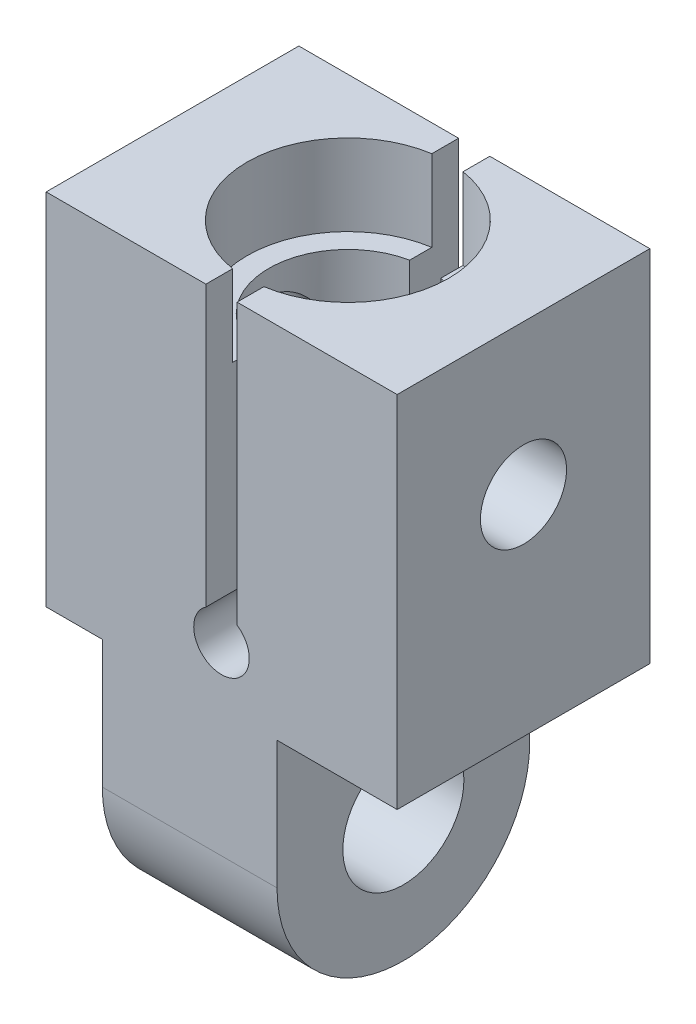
ISO-10303-21;
HEADER;
FILE_DESCRIPTION(('STEP AP214'),'2;1');
FILE_NAME('part.step','',(''),(''),'','','');
FILE_SCHEMA(('AUTOMOTIVE_DESIGN { 1 0 10303 214 1 1 1 1 }'));
ENDSEC;
DATA;
#1=APPLICATION_CONTEXT('core data for automotive mechanical design processes');
#2=APPLICATION_PROTOCOL_DEFINITION('international standard','automotive_design',2000,#1);
#3=PRODUCT_CONTEXT('',#1,'mechanical');
#4=PRODUCT('Part','Part','',(#3));
#5=PRODUCT_RELATED_PRODUCT_CATEGORY('part','',(#4));
#6=PRODUCT_DEFINITION_FORMATION('','',#4);
#7=PRODUCT_DEFINITION_CONTEXT('part definition',#1,'design');
#8=PRODUCT_DEFINITION('design','',#6,#7);
#9=PRODUCT_DEFINITION_SHAPE('','',#8);
#10=(LENGTH_UNIT() NAMED_UNIT(*) SI_UNIT(.MILLI.,.METRE.));
#11=(NAMED_UNIT(*) PLANE_ANGLE_UNIT() SI_UNIT($,.RADIAN.));
#12=(NAMED_UNIT(*) SI_UNIT($,.STERADIAN.) SOLID_ANGLE_UNIT());
#13=UNCERTAINTY_MEASURE_WITH_UNIT(LENGTH_MEASURE(1.E-05),#10,'distance_accuracy_value','');
#14=(GEOMETRIC_REPRESENTATION_CONTEXT(3) GLOBAL_UNCERTAINTY_ASSIGNED_CONTEXT((#13)) GLOBAL_UNIT_ASSIGNED_CONTEXT((#10,
#11,#12)) REPRESENTATION_CONTEXT('',''));
#15=CARTESIAN_POINT('',(0.,0.,0.));
#16=DIRECTION('',(0.,0.,1.));
#17=DIRECTION('',(1.,0.,0.));
#18=AXIS2_PLACEMENT_3D('',#15,#16,#17);
#19=CARTESIAN_POINT('',(8.4455,57.2803396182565,-5.1435));
#20=DIRECTION('',(1.,0.,0.));
#21=DIRECTION('',(0.,0.,-1.));
#22=AXIS2_PLACEMENT_3D('',#19,#20,#21);
#23=PLANE('',#22);
#24=DIRECTION('',(0.,-1.,0.));
#25=VECTOR('',#24,1.);
#26=CARTESIAN_POINT('',(8.4455,57.2803396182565,-5.1435));
#27=LINE('',#26,#25);
#28=CARTESIAN_POINT('',(8.4455,19.8374,-5.1435));
#29=VERTEX_POINT('',#28);
#30=CARTESIAN_POINT('',(8.4455,5.207,-5.1435));
#31=VERTEX_POINT('',#30);
#32=EDGE_CURVE('E324',#29,#31,#27,.T.);
#33=ORIENTED_EDGE('',*,*,#32,.F.);
#34=DIRECTION('',(0.,0.,1.));
#35=VECTOR('',#34,1.);
#36=CARTESIAN_POINT('',(8.4455,19.8374,-5.1435));
#37=LINE('',#36,#35);
#38=CARTESIAN_POINT('',(8.4455,19.8374,5.1435));
#39=VERTEX_POINT('',#38);
#40=EDGE_CURVE('E327',#29,#39,#37,.T.);
#41=ORIENTED_EDGE('',*,*,#40,.T.);
#42=DIRECTION('',(0.,-1.,0.));
#43=VECTOR('',#42,1.);
#44=CARTESIAN_POINT('',(8.4455,57.2803396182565,5.1435));
#45=LINE('',#44,#43);
#46=CARTESIAN_POINT('',(8.4455,5.207,5.1435));
#47=VERTEX_POINT('',#46);
#48=EDGE_CURVE('E329',#39,#47,#45,.T.);
#49=ORIENTED_EDGE('',*,*,#48,.T.);
#50=DIRECTION('',(0.,0.,1.));
#51=VECTOR('',#50,1.);
#52=CARTESIAN_POINT('',(8.4455,5.207,-5.1435));
#53=LINE('',#52,#51);
#54=EDGE_CURVE('E311',#31,#47,#53,.T.);
#55=ORIENTED_EDGE('',*,*,#54,.F.);
#56=EDGE_LOOP('',(#33,#41,#49,#55));
#57=FACE_BOUND('',#56,.T.);
#58=CARTESIAN_POINT('',(8.4455,13.7414,0.));
#59=DIRECTION('',(-1.,0.,0.));
#60=DIRECTION('',(0.,0.,1.));
#61=AXIS2_PLACEMENT_3D('',#58,#59,#60);
#62=CIRCLE('',#61,1.7526);
#63=CARTESIAN_POINT('',(8.4455,13.7414,1.7526));
#64=VERTEX_POINT('',#63);
#65=EDGE_CURVE('E662',#64,#64,#62,.T.);
#66=ORIENTED_EDGE('',*,*,#65,.T.);
#67=EDGE_LOOP('',(#66));
#68=FACE_BOUND('',#67,.T.);
#69=ADVANCED_FACE('F38',(#57,#68),#23,.T.);
#70=CARTESIAN_POINT('',(-5.842,57.2803396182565,-5.1435));
#71=DIRECTION('',(1.,0.,0.));
#72=DIRECTION('',(0.,0.,-1.));
#73=AXIS2_PLACEMENT_3D('',#70,#71,#72);
#74=PLANE('',#73);
#75=DIRECTION('',(0.,0.,1.));
#76=VECTOR('',#75,1.);
#77=CARTESIAN_POINT('',(-5.842,19.8374,-5.1435));
#78=LINE('',#77,#76);
#79=CARTESIAN_POINT('',(-5.842,19.8374,-5.1435));
#80=VERTEX_POINT('',#79);
#81=CARTESIAN_POINT('',(-5.842,19.8374,5.1435));
#82=VERTEX_POINT('',#81);
#83=EDGE_CURVE('E302',#80,#82,#78,.T.);
#84=ORIENTED_EDGE('',*,*,#83,.F.);
#85=DIRECTION('',(0.,-1.,0.));
#86=VECTOR('',#85,1.);
#87=CARTESIAN_POINT('',(-5.842,57.2803396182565,-5.1435));
#88=LINE('',#87,#86);
#89=CARTESIAN_POINT('',(-5.842,5.207,-5.1435));
#90=VERTEX_POINT('',#89);
#91=EDGE_CURVE('E320',#80,#90,#88,.T.);
#92=ORIENTED_EDGE('',*,*,#91,.T.);
#93=DIRECTION('',(0.,0.,1.));
#94=VECTOR('',#93,1.);
#95=CARTESIAN_POINT('',(-5.842,5.207,-5.1435));
#96=LINE('',#95,#94);
#97=CARTESIAN_POINT('',(-5.842,5.207,5.1435));
#98=VERTEX_POINT('',#97);
#99=EDGE_CURVE('E322',#90,#98,#96,.T.);
#100=ORIENTED_EDGE('',*,*,#99,.T.);
#101=DIRECTION('',(0.,-1.,0.));
#102=VECTOR('',#101,1.);
#103=CARTESIAN_POINT('',(-5.842,57.2803396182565,5.1435));
#104=LINE('',#103,#102);
#105=EDGE_CURVE('E332',#82,#98,#104,.T.);
#106=ORIENTED_EDGE('',*,*,#105,.F.);
#107=EDGE_LOOP('',(#84,#92,#100,#106));
#108=FACE_BOUND('',#107,.T.);
#109=CARTESIAN_POINT('',(-5.842,13.7414,0.));
#110=DIRECTION('',(-1.,0.,0.));
#111=DIRECTION('',(0.,0.,1.));
#112=AXIS2_PLACEMENT_3D('',#109,#110,#111);
#113=CIRCLE('',#112,3.175);
#114=CARTESIAN_POINT('',(-5.842,13.7414,3.175));
#115=VERTEX_POINT('',#114);
#116=EDGE_CURVE('E818',#115,#115,#113,.T.);
#117=ORIENTED_EDGE('',*,*,#116,.F.);
#118=EDGE_LOOP('',(#117));
#119=FACE_BOUND('',#118,.T.);
#120=ADVANCED_FACE('F257',(#108,#119),#74,.F.);
#121=CARTESIAN_POINT('',(1.2954,20.416711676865,0.));
#122=DIRECTION('',(0.,1.,0.));
#123=DIRECTION('',(-1.,0.,0.));
#124=AXIS2_PLACEMENT_3D('',#121,#122,#123);
#125=CYLINDRICAL_SURFACE('',#124,3.2131);
#126=CARTESIAN_POINT('',(1.2954,8.328025,0.));
#127=DIRECTION('',(0.,1.,0.));
#128=DIRECTION('',(-1.,0.,0.));
#129=AXIS2_PLACEMENT_3D('',#126,#127,#128);
#130=CIRCLE('',#129,3.2131);
#131=CARTESIAN_POINT('',(2.08412393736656,8.328025,3.11479151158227));
#132=VERTEX_POINT('',#131);
#133=CARTESIAN_POINT('',(2.08412393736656,8.328025,-3.11479151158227));
#134=VERTEX_POINT('',#133);
#135=EDGE_CURVE('E208',#132,#134,#130,.T.);
#136=ORIENTED_EDGE('',*,*,#135,.F.);
#137=CARTESIAN_POINT('',(1.9304,8.45346849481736,3.1497280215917));
#138=CARTESIAN_POINT('',(1.94412996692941,8.44414471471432,3.14696012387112));
#139=CARTESIAN_POINT('',(1.95764725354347,8.43452317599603,3.14414142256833));
#140=CARTESIAN_POINT('',(1.9842096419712,8.41472203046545,3.13842904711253));
#141=CARTESIAN_POINT('',(1.99725558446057,8.4045435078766,3.13553552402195));
#142=CARTESIAN_POINT('',(2.02288025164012,8.38363064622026,3.12968957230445));
#143=CARTESIAN_POINT('',(2.03545897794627,8.3728963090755,3.12673714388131));
#144=CARTESIAN_POINT('',(2.06015206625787,8.35087022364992,3.12078957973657));
#145=CARTESIAN_POINT('',(2.07226550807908,8.3395774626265,3.11779437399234));
#146=CARTESIAN_POINT('',(2.08412393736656,8.328025,3.11479151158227));
#147=B_SPLINE_CURVE_WITH_KNOTS('',3,(#137,#138,#139,#140,#141,#142,#143,#144,#145,#146),
.UNSPECIFIED.,.F.,.F.,(4,2,2,2,4),(0.,0.0504729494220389,0.100850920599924,0.1512287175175,
0.20170149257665),.UNSPECIFIED.);
#148=CARTESIAN_POINT('',(1.9304,8.45346849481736,3.1497280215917));
#149=VERTEX_POINT('',#148);
#150=EDGE_CURVE('E697',#149,#132,#147,.T.);
#151=ORIENTED_EDGE('',*,*,#150,.F.);
#152=DIRECTION('',(0.,1.,0.));
#153=VECTOR('',#152,1.);
#154=CARTESIAN_POINT('',(1.9304,20.416711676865,3.1497280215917));
#155=LINE('',#154,#153);
#156=CARTESIAN_POINT('',(1.9304,16.5354,3.1497280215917));
#157=VERTEX_POINT('',#156);
#158=EDGE_CURVE('E694',#157,#149,#155,.F.);
#159=ORIENTED_EDGE('',*,*,#158,.F.);
#160=CARTESIAN_POINT('',(1.2954,16.5354,0.));
#161=DIRECTION('',(0.,1.,0.));
#162=DIRECTION('',(-1.,0.,0.));
#163=AXIS2_PLACEMENT_3D('',#160,#161,#162);
#164=CIRCLE('',#163,3.2131);
#165=CARTESIAN_POINT('',(1.9304,16.5354,-3.1497280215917));
#166=VERTEX_POINT('',#165);
#167=EDGE_CURVE('E678',#157,#166,#164,.T.);
#168=ORIENTED_EDGE('',*,*,#167,.T.);
#169=DIRECTION('',(0.,1.,0.));
#170=VECTOR('',#169,1.);
#171=CARTESIAN_POINT('',(1.9304,20.416711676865,-3.1497280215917));
#172=LINE('',#171,#170);
#173=CARTESIAN_POINT('',(1.9304,8.45346849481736,-3.1497280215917));
#174=VERTEX_POINT('',#173);
#175=EDGE_CURVE('E702',#174,#166,#172,.T.);
#176=ORIENTED_EDGE('',*,*,#175,.F.);
#177=CARTESIAN_POINT('',(2.08412393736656,8.328025,-3.11479151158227));
#178=CARTESIAN_POINT('',(2.07226550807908,8.3395774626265,-3.11779437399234));
#179=CARTESIAN_POINT('',(2.06015206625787,8.35087022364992,-3.12078957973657));
#180=CARTESIAN_POINT('',(2.03545897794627,8.3728963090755,-3.12673714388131));
#181=CARTESIAN_POINT('',(2.02288025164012,8.38363064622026,-3.12968957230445));
#182=CARTESIAN_POINT('',(1.99725558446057,8.4045435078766,-3.13553552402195));
#183=CARTESIAN_POINT('',(1.9842096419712,8.41472203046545,-3.13842904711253));
#184=CARTESIAN_POINT('',(1.95764725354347,8.43452317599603,-3.14414142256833));
#185=CARTESIAN_POINT('',(1.94412996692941,8.44414471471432,-3.14696012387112));
#186=CARTESIAN_POINT('',(1.9304,8.45346849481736,-3.1497280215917));
#187=B_SPLINE_CURVE_WITH_KNOTS('',3,(#177,#178,#179,#180,#181,#182,#183,#184,#185,#186),
.UNSPECIFIED.,.F.,.F.,(4,2,2,2,4),(0.,0.0504727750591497,0.100850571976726,0.151228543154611,
0.201701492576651),.UNSPECIFIED.);
#188=EDGE_CURVE('E223',#134,#174,#187,.T.);
#189=ORIENTED_EDGE('',*,*,#188,.F.);
#190=EDGE_LOOP('',(#136,#151,#159,#168,#176,#189));
#191=FACE_BOUND('',#190,.T.);
#192=CARTESIAN_POINT('',(3.98842893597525,13.7414,1.7526));
#193=CARTESIAN_POINT('',(3.98843839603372,13.8313642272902,1.75259314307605));
#194=CARTESIAN_POINT('',(3.99300810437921,13.9214105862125,1.74562497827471));
#195=CARTESIAN_POINT('',(4.01057727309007,14.098628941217,1.71815919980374));
#196=CARTESIAN_POINT('',(4.02359124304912,14.1857957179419,1.69763829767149));
#197=CARTESIAN_POINT('',(4.05606804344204,14.3543391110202,1.6442878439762));
#198=CARTESIAN_POINT('',(4.07549116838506,14.4357477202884,1.61153391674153));
#199=CARTESIAN_POINT('',(4.11853354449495,14.5918848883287,1.53487979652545));
#200=CARTESIAN_POINT('',(4.14215361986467,14.6666121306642,1.49097741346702));
#201=CARTESIAN_POINT('',(4.19377921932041,14.8154318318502,1.38817586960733));
#202=CARTESIAN_POINT('',(4.22198731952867,14.8887247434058,1.32822056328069));
#203=CARTESIAN_POINT('',(4.27798425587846,15.0248548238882,1.197197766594));
#204=CARTESIAN_POINT('',(4.30577283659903,15.0876858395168,1.12612378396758));
#205=CARTESIAN_POINT('',(4.3605838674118,15.2063039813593,0.967605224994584));
#206=CARTESIAN_POINT('',(4.38734567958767,15.2610554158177,0.879286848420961));
#207=CARTESIAN_POINT('',(4.43435289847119,15.3545512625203,0.692956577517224));
#208=CARTESIAN_POINT('',(4.45460318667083,15.3933076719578,0.594952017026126));
#209=CARTESIAN_POINT('',(4.48482674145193,15.450368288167,0.4005453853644));
#210=CARTESIAN_POINT('',(4.49550706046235,15.4700899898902,0.304671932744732));
#211=CARTESIAN_POINT('',(4.50807185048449,15.4932435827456,0.110434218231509));
#212=CARTESIAN_POINT('',(4.50996285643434,15.4966875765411,0.0120718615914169));
#213=CARTESIAN_POINT('',(4.50501767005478,15.4876089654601,-0.173464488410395));
#214=CARTESIAN_POINT('',(4.49906059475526,15.4766948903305,-0.260747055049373));
#215=CARTESIAN_POINT('',(4.48048960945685,15.4421653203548,-0.432013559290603));
#216=CARTESIAN_POINT('',(4.46787518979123,15.4185488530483,-0.515997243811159));
#217=CARTESIAN_POINT('',(4.43693799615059,15.3592690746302,-0.679529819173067));
#218=CARTESIAN_POINT('',(4.41855329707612,15.3234747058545,-0.75901900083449));
#219=CARTESIAN_POINT('',(4.37764840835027,15.2411090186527,-0.911021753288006));
#220=CARTESIAN_POINT('',(4.35512687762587,15.1945342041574,-0.98353305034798));
#221=CARTESIAN_POINT('',(4.30513751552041,15.0862655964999,-1.12779539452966));
#222=CARTESIAN_POINT('',(4.27739831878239,15.0234888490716,-1.19863976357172));
#223=CARTESIAN_POINT('',(4.22148326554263,14.8874397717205,-1.32932749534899));
#224=CARTESIAN_POINT('',(4.19330699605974,14.814156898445,-1.38915966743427));
#225=CARTESIAN_POINT('',(4.13698717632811,14.6516238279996,-1.50121734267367));
#226=CARTESIAN_POINT('',(4.10905202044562,14.5615444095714,-1.55235648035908));
#227=CARTESIAN_POINT('',(4.05983678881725,14.3722743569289,-1.63840700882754));
#228=CARTESIAN_POINT('',(4.03854905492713,14.2730943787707,-1.67333709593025));
#229=CARTESIAN_POINT('',(4.00763953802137,14.0767213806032,-1.72295283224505));
#230=CARTESIAN_POINT('',(3.99721262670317,13.9800178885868,-1.73904884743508));
#231=CARTESIAN_POINT('',(3.98702170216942,13.7847653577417,-1.75479037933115));
#232=CARTESIAN_POINT('',(3.98724603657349,13.6862184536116,-1.75445387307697));
#233=CARTESIAN_POINT('',(3.99747751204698,13.5050916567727,-1.73863151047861));
#234=CARTESIAN_POINT('',(4.00609292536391,13.422229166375,-1.72530062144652));
#235=CARTESIAN_POINT('',(4.02991659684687,13.2601413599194,-1.6872848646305));
#236=CARTESIAN_POINT('',(4.04512765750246,13.1809176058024,-1.66259517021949));
#237=CARTESIAN_POINT('',(4.08115215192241,13.0244126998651,-1.60152970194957));
#238=CARTESIAN_POINT('',(4.10217757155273,12.947359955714,-1.56469883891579));
#239=CARTESIAN_POINT('',(4.14734484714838,12.8000668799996,-1.4807743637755));
#240=CARTESIAN_POINT('',(4.1714882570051,12.7298299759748,-1.43367562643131));
#241=CARTESIAN_POINT('',(4.22466583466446,12.5867267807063,-1.32204346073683));
#242=CARTESIAN_POINT('',(4.25387718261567,12.5151465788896,-1.25593829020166));
#243=CARTESIAN_POINT('',(4.31078247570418,12.3835907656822,-1.11240442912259));
#244=CARTESIAN_POINT('',(4.33847556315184,12.3236216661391,-1.03496942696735));
#245=CARTESIAN_POINT('',(4.39086791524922,12.2143350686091,-0.86617403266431));
#246=CARTESIAN_POINT('',(4.41535958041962,12.1656672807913,-0.774323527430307));
#247=CARTESIAN_POINT('',(4.45687033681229,12.0849906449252,-0.582026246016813));
#248=CARTESIAN_POINT('',(4.47389709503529,12.0529646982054,-0.481588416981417));
#249=CARTESIAN_POINT('',(4.49711566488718,12.0096744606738,-0.285900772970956));
#250=CARTESIAN_POINT('',(4.50422864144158,11.9966389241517,-0.191152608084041));
#251=CARTESIAN_POINT('',(4.50991103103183,11.9862077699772,-0.000560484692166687));
#252=CARTESIAN_POINT('',(4.50848478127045,11.9888042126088,0.0952828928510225));
#253=CARTESIAN_POINT('',(4.49775805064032,12.0085561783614,0.276475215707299));
#254=CARTESIAN_POINT('',(4.48915399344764,12.0244243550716,0.362011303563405));
#255=CARTESIAN_POINT('',(4.46577489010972,12.0683141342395,0.529004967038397));
#256=CARTESIAN_POINT('',(4.45099909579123,12.0963372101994,0.610462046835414));
#257=CARTESIAN_POINT('',(4.41591502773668,12.1646635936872,0.770279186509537));
#258=CARTESIAN_POINT('',(4.39543026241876,12.2053645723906,0.848429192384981));
#259=CARTESIAN_POINT('',(4.35087413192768,12.2973993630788,0.997055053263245));
#260=CARTESIAN_POINT('',(4.32680128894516,12.3487375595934,1.06752772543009));
#261=CARTESIAN_POINT('',(4.27409412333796,12.4672926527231,1.20730491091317));
#262=CARTESIAN_POINT('',(4.2452524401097,12.5356516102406,1.27556417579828));
#263=CARTESIAN_POINT('',(4.18820005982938,12.6828673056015,1.40015221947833));
#264=CARTESIAN_POINT('',(4.15999014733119,12.7617363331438,1.4564668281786));
#265=CARTESIAN_POINT('',(4.10562497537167,12.9339060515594,1.55891578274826));
#266=CARTESIAN_POINT('',(4.07971069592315,13.0278025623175,1.60418657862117));
#267=CARTESIAN_POINT('',(4.03609793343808,13.2236966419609,1.67763088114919));
#268=CARTESIAN_POINT('',(4.01837308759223,13.3256669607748,1.70585934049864));
#269=CARTESIAN_POINT('',(4.00050173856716,13.4810471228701,1.73393837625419));
#270=CARTESIAN_POINT('',(3.99600002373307,13.5327563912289,1.74091984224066));
#271=CARTESIAN_POINT('',(3.989960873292,13.6367678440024,1.75025264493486));
#272=CARTESIAN_POINT('',(3.98842343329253,13.6890700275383,1.75260398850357));
#273=CARTESIAN_POINT('',(3.98842893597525,13.7414,1.7526));
#274=B_SPLINE_CURVE_WITH_KNOTS('',3,(#192,#193,#194,#195,#196,#197,#198,#199,#200,#201,#202,
#203,#204,#205,#206,#207,#208,#209,#210,#211,#212,#213,#214,#215,#216,#217,#218,#219,#220,#221,
#222,#223,#224,#225,#226,#227,#228,#229,#230,#231,#232,#233,#234,#235,#236,#237,#238,#239,#240,
#241,#242,#243,#244,#245,#246,#247,#248,#249,#250,#251,#252,#253,#254,#255,#256,#257,#258,#259,
#260,#261,#262,#263,#264,#265,#266,#267,#268,#269,#270,#271,#272,#273),.UNSPECIFIED.,.T.,.F.,(4,
2,2,2,2,2,2,2,2,2,2,2,2,2,2,2,2,2,2,2,2,2,2,2,2,2,2,2,2,2,2,2,2,2,2,2,2,2,2,2,4),(0.,
0.269670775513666,0.539806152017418,0.808298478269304,1.07684358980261,1.37204943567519,
1.6674283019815,1.98763022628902,2.30759154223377,2.60129304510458,2.89477614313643,
3.15802072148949,3.42128545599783,3.68747808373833,3.95375715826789,4.24844864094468,
4.54343795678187,4.86362581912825,5.1834434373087,5.47736146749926,5.7709579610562,
6.02292202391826,6.27499325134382,6.53785714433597,6.80085254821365,7.10469735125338,
7.40871206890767,7.72732439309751,8.04560870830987,8.33172369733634,8.61769337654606,
8.87876361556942,9.13986551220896,9.41016145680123,9.68056903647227,9.9817436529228,
10.2832735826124,10.6037768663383,10.9232410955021,11.080102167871,11.2369630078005),.UNSPECIFIED.);
#275=CARTESIAN_POINT('',(3.98842893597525,13.7414,1.7526));
#276=VERTEX_POINT('',#275);
#277=EDGE_CURVE('E43',#276,#276,#274,.T.);
#278=ORIENTED_EDGE('',*,*,#277,.F.);
#279=EDGE_LOOP('',(#278));
#280=FACE_BOUND('',#279,.T.);
#281=ADVANCED_FACE('F243',(#191,#280),#125,.F.);
#282=CARTESIAN_POINT('',(0.506676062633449,8.328025,-3.11479151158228));
#283=VERTEX_POINT('',#282);
#284=CARTESIAN_POINT('',(0.506676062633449,8.328025,3.11479151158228));
#285=VERTEX_POINT('',#284);
#286=EDGE_CURVE('E215',#283,#285,#130,.T.);
#287=ORIENTED_EDGE('',*,*,#286,.F.);
#288=CARTESIAN_POINT('',(0.660400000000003,8.45346849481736,-3.1497280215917));
#289=CARTESIAN_POINT('',(0.646670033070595,8.44414471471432,-3.14696012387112));
#290=CARTESIAN_POINT('',(0.633152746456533,8.43452317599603,-3.14414142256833));
#291=CARTESIAN_POINT('',(0.606590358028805,8.41472203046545,-3.13842904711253));
#292=CARTESIAN_POINT('',(0.593544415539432,8.4045435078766,-3.13553552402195));
#293=CARTESIAN_POINT('',(0.567919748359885,8.38363064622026,-3.12968957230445));
#294=CARTESIAN_POINT('',(0.555341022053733,8.3728963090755,-3.12673714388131));
#295=CARTESIAN_POINT('',(0.530647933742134,8.35087022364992,-3.12078957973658));
#296=CARTESIAN_POINT('',(0.518534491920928,8.3395774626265,-3.11779437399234));
#297=CARTESIAN_POINT('',(0.506676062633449,8.328025,-3.11479151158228));
#298=B_SPLINE_CURVE_WITH_KNOTS('',3,(#288,#289,#290,#291,#292,#293,#294,#295,#296,#297),
.UNSPECIFIED.,.F.,.F.,(4,2,2,2,4),(0.,0.0504729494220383,0.100850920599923,0.1512287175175,
0.20170149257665),.UNSPECIFIED.);
#299=CARTESIAN_POINT('',(0.660400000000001,8.45346849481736,-3.1497280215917));
#300=VERTEX_POINT('',#299);
#301=EDGE_CURVE('E225',#300,#283,#298,.T.);
#302=ORIENTED_EDGE('',*,*,#301,.F.);
#303=DIRECTION('',(0.,1.,0.));
#304=VECTOR('',#303,1.);
#305=CARTESIAN_POINT('',(0.660400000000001,20.416711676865,-3.1497280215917));
#306=LINE('',#305,#304);
#307=CARTESIAN_POINT('',(0.660400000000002,16.5354,-3.1497280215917));
#308=VERTEX_POINT('',#307);
#309=EDGE_CURVE('E229',#308,#300,#306,.F.);
#310=ORIENTED_EDGE('',*,*,#309,.F.);
#311=CARTESIAN_POINT('',(0.660400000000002,16.5354,3.1497280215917));
#312=VERTEX_POINT('',#311);
#313=EDGE_CURVE('E676',#308,#312,#164,.T.);
#314=ORIENTED_EDGE('',*,*,#313,.T.);
#315=DIRECTION('',(0.,1.,0.));
#316=VECTOR('',#315,1.);
#317=CARTESIAN_POINT('',(0.660400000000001,20.416711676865,3.1497280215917));
#318=LINE('',#317,#316);
#319=CARTESIAN_POINT('',(0.660400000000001,8.45346849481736,3.1497280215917));
#320=VERTEX_POINT('',#319);
#321=EDGE_CURVE('E715',#320,#312,#318,.T.);
#322=ORIENTED_EDGE('',*,*,#321,.F.);
#323=CARTESIAN_POINT('',(0.506676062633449,8.328025,3.11479151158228));
#324=CARTESIAN_POINT('',(0.518534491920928,8.3395774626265,3.11779437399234));
#325=CARTESIAN_POINT('',(0.530647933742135,8.35087022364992,3.12078957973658));
#326=CARTESIAN_POINT('',(0.555341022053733,8.3728963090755,3.12673714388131));
#327=CARTESIAN_POINT('',(0.567919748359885,8.38363064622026,3.12968957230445));
#328=CARTESIAN_POINT('',(0.593544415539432,8.4045435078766,3.13553552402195));
#329=CARTESIAN_POINT('',(0.606590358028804,8.41472203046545,3.13842904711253));
#330=CARTESIAN_POINT('',(0.633152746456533,8.43452317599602,3.14414142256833));
#331=CARTESIAN_POINT('',(0.646670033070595,8.44414471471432,3.14696012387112));
#332=CARTESIAN_POINT('',(0.660400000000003,8.45346849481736,3.1497280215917));
#333=B_SPLINE_CURVE_WITH_KNOTS('',3,(#323,#324,#325,#326,#327,#328,#329,#330,#331,#332),
.UNSPECIFIED.,.F.,.F.,(4,2,2,2,4),(0.,0.0504727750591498,0.100850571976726,0.151228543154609,
0.20170149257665),.UNSPECIFIED.);
#334=EDGE_CURVE('E396',#285,#320,#333,.T.);
#335=ORIENTED_EDGE('',*,*,#334,.F.);
#336=EDGE_LOOP('',(#287,#302,#310,#314,#322,#335));
#337=FACE_BOUND('',#336,.T.);
#338=CARTESIAN_POINT('',(-1.36387810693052,13.7414,1.8034));
#339=CARTESIAN_POINT('',(-1.36388784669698,13.6493490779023,1.80339318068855));
#340=CARTESIAN_POINT('',(-1.36873392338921,13.5572268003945,1.79630278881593));
#341=CARTESIAN_POINT('',(-1.38734449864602,13.3759653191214,1.76837637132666));
#342=CARTESIAN_POINT('',(-1.40112329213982,13.286831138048,1.74751831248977));
#343=CARTESIAN_POINT('',(-1.43546389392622,13.1145385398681,1.6933413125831));
#344=CARTESIAN_POINT('',(-1.45598170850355,13.0313455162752,1.66010300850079));
#345=CARTESIAN_POINT('',(-1.50141599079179,12.8717527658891,1.58235728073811));
#346=CARTESIAN_POINT('',(-1.52633349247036,12.7953546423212,1.5378472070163));
#347=CARTESIAN_POINT('',(-1.58095278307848,12.6426472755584,1.43332984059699));
#348=CARTESIAN_POINT('',(-1.61088192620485,12.5671994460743,1.37218235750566));
#349=CARTESIAN_POINT('',(-1.6703283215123,12.4269334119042,1.23847696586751));
#350=CARTESIAN_POINT('',(-1.69984530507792,12.3621218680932,1.16591196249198));
#351=CARTESIAN_POINT('',(-1.75832228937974,12.2391870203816,1.00344079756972));
#352=CARTESIAN_POINT('',(-1.7869901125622,12.1821998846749,0.912559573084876));
#353=CARTESIAN_POINT('',(-1.83742378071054,12.0847264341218,0.720585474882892));
#354=CARTESIAN_POINT('',(-1.85919509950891,12.0442270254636,0.619500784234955));
#355=CARTESIAN_POINT('',(-1.89171403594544,11.984555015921,0.419178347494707));
#356=CARTESIAN_POINT('',(-1.90324811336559,11.9638489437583,0.32052819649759));
#357=CARTESIAN_POINT('',(-1.91699733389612,11.9392215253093,0.120541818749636));
#358=CARTESIAN_POINT('',(-1.91921990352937,11.9352868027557,0.0192077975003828));
#359=CARTESIAN_POINT('',(-1.91438659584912,11.9439093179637,-0.171399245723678));
#360=CARTESIAN_POINT('',(-1.90831498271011,11.9547168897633,-0.260783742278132));
#361=CARTESIAN_POINT('',(-1.88917323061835,11.9892717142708,-0.43622425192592));
#362=CARTESIAN_POINT('',(-1.87610255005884,12.0130199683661,-0.522280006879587));
#363=CARTESIAN_POINT('',(-1.84395621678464,12.0727374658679,-0.689788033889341));
#364=CARTESIAN_POINT('',(-1.82482286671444,12.1088244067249,-0.771186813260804));
#365=CARTESIAN_POINT('',(-1.78215719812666,12.1919263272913,-0.92692057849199));
#366=CARTESIAN_POINT('',(-1.75862352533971,12.2389446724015,-1.00125337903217));
#367=CARTESIAN_POINT('',(-1.70616677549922,12.3484866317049,-1.14954647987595));
#368=CARTESIAN_POINT('',(-1.67693549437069,12.4121502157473,-1.22255555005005));
#369=CARTESIAN_POINT('',(-1.61781558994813,12.5501991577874,-1.35743183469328));
#370=CARTESIAN_POINT('',(-1.58792628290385,12.6245961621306,-1.41928678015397));
#371=CARTESIAN_POINT('',(-1.52766498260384,12.7903767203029,-1.53590850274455));
#372=CARTESIAN_POINT('',(-1.49751062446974,12.8826989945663,-1.58946643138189));
#373=CARTESIAN_POINT('',(-1.44404306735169,13.0769801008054,-1.67995385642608));
#374=CARTESIAN_POINT('',(-1.42072195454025,13.1789276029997,-1.71690261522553));
#375=CARTESIAN_POINT('',(-1.38645951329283,13.3812469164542,-1.7699077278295));
#376=CARTESIAN_POINT('',(-1.3746771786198,13.4810925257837,-1.78739879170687));
#377=CARTESIAN_POINT('',(-1.36262304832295,13.6829411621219,-1.80528743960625));
#378=CARTESIAN_POINT('',(-1.36233650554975,13.7849412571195,-1.80570692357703));
#379=CARTESIAN_POINT('',(-1.37242009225,13.9712349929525,-1.79075050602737));
#380=CARTESIAN_POINT('',(-1.38115207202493,14.0558314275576,-1.7778028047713));
#381=CARTESIAN_POINT('',(-1.40560821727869,14.2213957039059,-1.74042001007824));
#382=CARTESIAN_POINT('',(-1.42133571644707,14.3023617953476,-1.71597943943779));
#383=CARTESIAN_POINT('',(-1.45869037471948,14.4621981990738,-1.65538668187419));
#384=CARTESIAN_POINT('',(-1.4805293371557,14.5408533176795,-1.61880307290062));
#385=CARTESIAN_POINT('',(-1.52755956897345,14.6913799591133,-1.53531954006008));
#386=CARTESIAN_POINT('',(-1.55275244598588,14.763248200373,-1.48841466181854));
#387=CARTESIAN_POINT('',(-1.60866851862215,14.9106969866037,-1.37656183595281));
#388=CARTESIAN_POINT('',(-1.63961462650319,14.984906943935,-1.30991046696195));
#389=CARTESIAN_POINT('',(-1.70011769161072,15.1216638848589,-1.16492950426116));
#390=CARTESIAN_POINT('',(-1.72967373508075,15.1842032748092,-1.08659236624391));
#391=CARTESIAN_POINT('',(-1.78613647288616,15.2992059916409,-0.914752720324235));
#392=CARTESIAN_POINT('',(-1.81279464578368,15.3508875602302,-0.820638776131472));
#393=CARTESIAN_POINT('',(-1.85831701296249,15.4371351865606,-0.623144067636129));
#394=CARTESIAN_POINT('',(-1.8771895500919,15.4717195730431,-0.519773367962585));
#395=CARTESIAN_POINT('',(-1.90334840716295,15.5192014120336,-0.318212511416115));
#396=CARTESIAN_POINT('',(-1.91163229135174,15.5339740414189,-0.220594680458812));
#397=CARTESIAN_POINT('',(-1.91911378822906,15.5473275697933,-0.0239301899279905));
#398=CARTESIAN_POINT('',(-1.91831664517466,15.5459178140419,0.0751156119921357));
#399=CARTESIAN_POINT('',(-1.90825273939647,15.5279254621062,0.261780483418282));
#400=CARTESIAN_POINT('',(-1.89979882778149,15.5127988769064,0.349590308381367));
#401=CARTESIAN_POINT('',(-1.8763294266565,15.4701061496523,0.521197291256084));
#402=CARTESIAN_POINT('',(-1.86131318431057,15.4425385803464,0.604993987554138));
#403=CARTESIAN_POINT('',(-1.82542534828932,15.3749953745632,0.769256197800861));
#404=CARTESIAN_POINT('',(-1.80438467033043,15.3346572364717,0.849534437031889));
#405=CARTESIAN_POINT('',(-1.75837465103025,15.2431794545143,1.00242510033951));
#406=CARTESIAN_POINT('',(-1.73340380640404,15.1920356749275,1.0750345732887));
#407=CARTESIAN_POINT('',(-1.67835234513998,15.0735103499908,1.21961993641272));
#408=CARTESIAN_POINT('',(-1.64801631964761,15.0049256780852,1.29051346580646));
#409=CARTESIAN_POINT('',(-1.58761064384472,14.8569941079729,1.42035268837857));
#410=CARTESIAN_POINT('',(-1.55754138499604,14.7776335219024,1.47928294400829));
#411=CARTESIAN_POINT('',(-1.49870128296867,14.6030829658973,1.58779630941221));
#412=CARTESIAN_POINT('',(-1.47019795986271,14.5071515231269,1.63634377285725));
#413=CARTESIAN_POINT('',(-1.42152898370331,14.3064610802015,1.71596058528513));
#414=CARTESIAN_POINT('',(-1.40133750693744,14.201730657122,1.74708417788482));
#415=CARTESIAN_POINT('',(-1.37959380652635,14.0365972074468,1.78005534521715));
#416=CARTESIAN_POINT('',(-1.37373999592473,13.9780636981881,1.78878524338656));
#417=CARTESIAN_POINT('',(-1.36587917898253,13.8601633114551,1.80045950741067));
#418=CARTESIAN_POINT('',(-1.36387182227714,13.8007965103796,1.80340440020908));
#419=CARTESIAN_POINT('',(-1.36387810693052,13.7414,1.8034));
#420=B_SPLINE_CURVE_WITH_KNOTS('',3,(#338,#339,#340,#341,#342,#343,#344,#345,#346,#347,#348,
#349,#350,#351,#352,#353,#354,#355,#356,#357,#358,#359,#360,#361,#362,#363,#364,#365,#366,#367,
#368,#369,#370,#371,#372,#373,#374,#375,#376,#377,#378,#379,#380,#381,#382,#383,#384,#385,#386,
#387,#388,#389,#390,#391,#392,#393,#394,#395,#396,#397,#398,#399,#400,#401,#402,#403,#404,#405,
#406,#407,#408,#409,#410,#411,#412,#413,#414,#415,#416,#417,#418,#419),.UNSPECIFIED.,.T.,.F.,(4,
2,2,2,2,2,2,2,2,2,2,2,2,2,2,2,2,2,2,2,2,2,2,2,2,2,2,2,2,2,2,2,2,2,2,2,2,2,2,2,4),(0.,
0.275899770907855,0.552242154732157,0.826815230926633,1.10145292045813,1.40509378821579,
1.70892408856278,2.04025201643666,2.37131630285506,2.6739344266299,2.97631114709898,
3.24575219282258,3.51521409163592,3.78732158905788,4.05951297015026,4.36182111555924,
4.66445978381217,4.99548193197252,5.32611918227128,5.6303100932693,5.934110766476,
6.19101638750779,6.44804456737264,6.71540823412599,6.9829005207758,7.29488178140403,
7.607065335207,7.93712007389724,8.2668202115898,8.56237242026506,8.85775395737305,
9.1250385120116,9.39235373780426,9.66806438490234,9.94388074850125,10.2521903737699,
10.5608953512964,10.8928062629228,11.2236780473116,11.4017205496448,11.579746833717),.UNSPECIFIED.);
#421=CARTESIAN_POINT('',(-1.36387810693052,13.7414,1.8034));
#422=VERTEX_POINT('',#421);
#423=EDGE_CURVE('E658',#422,#422,#420,.T.);
#424=ORIENTED_EDGE('',*,*,#423,.F.);
#425=EDGE_LOOP('',(#424));
#426=FACE_BOUND('',#425,.T.);
#427=ADVANCED_FACE('F596',(#337,#426),#125,.F.);
#428=CARTESIAN_POINT('',(1.2954,7.51840000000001,-5.14355));
#429=DIRECTION('',(0.,0.,1.));
#430=DIRECTION('',(1.,0.,0.));
#431=AXIS2_PLACEMENT_3D('',#428,#429,#430);
#432=CYLINDRICAL_SURFACE('',#431,1.1303);
#433=DIRECTION('',(0.,0.,1.));
#434=VECTOR('',#433,1.);
#435=CARTESIAN_POINT('',(1.9304,8.45346849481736,-5.14355));
#436=LINE('',#435,#434);
#437=CARTESIAN_POINT('',(1.9304,8.45346849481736,5.1435));
#438=VERTEX_POINT('',#437);
#439=EDGE_CURVE('E389',#149,#438,#436,.T.);
#440=ORIENTED_EDGE('',*,*,#439,.F.);
#441=ORIENTED_EDGE('',*,*,#150,.T.);
#442=CARTESIAN_POINT('',(1.81494645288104,8.52221749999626,3.45155217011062));
#443=CARTESIAN_POINT('',(1.84869357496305,8.50471142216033,3.42117789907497));
#444=CARTESIAN_POINT('',(1.88028608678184,8.48624106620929,3.38913449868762));
#445=CARTESIAN_POINT('',(1.93954313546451,8.44787267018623,3.32258142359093));
#446=CARTESIAN_POINT('',(1.96722010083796,8.42797946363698,3.28808010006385));
#447=CARTESIAN_POINT('',(2.01890539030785,8.38740971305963,3.21773178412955));
#448=CARTESIAN_POINT('',(2.04295637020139,8.36674655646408,3.18190784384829));
#449=CARTESIAN_POINT('',(2.08820297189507,8.3246245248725,3.10889553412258));
#450=CARTESIAN_POINT('',(2.10939549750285,8.30316481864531,3.07170573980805));
#451=CARTESIAN_POINT('',(2.16396256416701,8.24353351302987,2.96838882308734));
#452=CARTESIAN_POINT('',(2.19473269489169,8.20475749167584,2.90123236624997));
#453=CARTESIAN_POINT('',(2.24968253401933,8.1260374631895,2.76496832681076));
#454=CARTESIAN_POINT('',(2.27386001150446,8.08609306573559,2.69586009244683));
#455=CARTESIAN_POINT('',(2.31665677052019,8.00495803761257,2.5555818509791));
#456=CARTESIAN_POINT('',(2.33521165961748,7.96375851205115,2.48439749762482));
#457=CARTESIAN_POINT('',(2.36695334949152,7.88078535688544,2.34116477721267));
#458=CARTESIAN_POINT('',(2.38013864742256,7.83901156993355,2.26911617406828));
#459=CARTESIAN_POINT('',(2.40621126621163,7.73652992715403,2.09257091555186));
#460=CARTESIAN_POINT('',(2.41639657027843,7.67560584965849,1.98779323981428));
#461=CARTESIAN_POINT('',(2.42682972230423,7.5532570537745,1.77794942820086));
#462=CARTESIAN_POINT('',(2.42706943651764,7.49183196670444,1.67288312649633));
#463=CARTESIAN_POINT('',(2.41749388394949,7.36928814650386,1.46424579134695));
#464=CARTESIAN_POINT('',(2.40776845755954,7.30817158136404,1.36066978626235));
#465=CARTESIAN_POINT('',(2.3850732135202,7.21644665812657,1.20663952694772));
#466=CARTESIAN_POINT('',(2.37616357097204,7.18587897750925,1.15554417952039));
#467=CARTESIAN_POINT('',(2.35540943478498,7.12469564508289,1.05398731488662));
#468=CARTESIAN_POINT('',(2.34356551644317,7.09408000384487,1.00352567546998));
#469=CARTESIAN_POINT('',(2.31633705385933,7.03215566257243,0.902568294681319));
#470=CARTESIAN_POINT('',(2.30088869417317,7.00084497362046,0.852090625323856));
#471=CARTESIAN_POINT('',(2.26585134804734,6.93778684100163,0.752383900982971));
#472=CARTESIAN_POINT('',(2.24623679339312,6.90603788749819,0.703164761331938));
#473=CARTESIAN_POINT('',(2.20146224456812,6.84148353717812,0.606676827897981));
#474=CARTESIAN_POINT('',(2.17622676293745,6.80866951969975,0.559446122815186));
#475=CARTESIAN_POINT('',(2.13243900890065,6.75851585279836,0.493478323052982));
#476=CARTESIAN_POINT('',(2.1169169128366,6.7417014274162,0.472365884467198));
#477=CARTESIAN_POINT('',(2.08327513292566,6.70759437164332,0.432812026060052));
#478=CARTESIAN_POINT('',(2.06516472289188,6.69030361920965,0.414361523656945));
#479=CARTESIAN_POINT('',(2.02962905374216,6.6587920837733,0.385329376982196));
#480=CARTESIAN_POINT('',(2.01282628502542,6.64466970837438,0.37390991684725));
#481=CARTESIAN_POINT('',(1.97706593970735,6.61650267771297,0.355495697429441));
#482=CARTESIAN_POINT('',(1.95812839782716,6.60245841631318,0.348463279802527));
#483=CARTESIAN_POINT('',(1.91853533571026,6.57507645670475,0.339566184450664));
#484=CARTESIAN_POINT('',(1.89787549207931,6.56174068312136,0.337714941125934));
#485=CARTESIAN_POINT('',(1.85563738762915,6.53639707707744,0.338344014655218));
#486=CARTESIAN_POINT('',(1.83405186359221,6.52440432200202,0.340869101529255));
#487=CARTESIAN_POINT('',(1.78595009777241,6.49966525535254,0.349316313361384));
#488=CARTESIAN_POINT('',(1.75936102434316,6.48730059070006,0.355846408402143));
#489=CARTESIAN_POINT('',(1.7055797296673,6.46474755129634,0.370197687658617));
#490=CARTESIAN_POINT('',(1.6783862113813,6.45456448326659,0.378021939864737));
#491=CARTESIAN_POINT('',(1.62326562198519,6.43630866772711,0.393358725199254));
#492=CARTESIAN_POINT('',(1.59534007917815,6.42823185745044,0.40087183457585));
#493=CARTESIAN_POINT('',(1.53864518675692,6.41419758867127,0.41456008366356));
#494=CARTESIAN_POINT('',(1.50987611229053,6.40823944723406,0.420735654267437));
#495=CARTESIAN_POINT('',(1.43770971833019,6.39625034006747,0.433443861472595));
#496=CARTESIAN_POINT('',(1.39385101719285,6.39152733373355,0.438754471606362));
#497=CARTESIAN_POINT('',(1.30558468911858,6.38728447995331,0.443512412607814));
#498=CARTESIAN_POINT('',(1.26117757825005,6.38776006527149,0.44296489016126));
#499=CARTESIAN_POINT('',(1.17340401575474,6.39384411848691,0.436181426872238));
#500=CARTESIAN_POINT('',(1.1300337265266,6.39942904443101,0.42997157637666));
#501=CARTESIAN_POINT('',(1.04488803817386,6.41535436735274,0.413363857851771));
#502=CARTESIAN_POINT('',(1.00311955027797,6.42571330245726,0.40294968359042));
#503=CARTESIAN_POINT('',(0.924386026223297,6.44998499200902,0.381517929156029));
#504=CARTESIAN_POINT('',(0.887291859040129,6.46358738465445,0.370598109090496));
#505=CARTESIAN_POINT('',(0.814190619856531,6.49488950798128,0.351431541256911));
#506=CARTESIAN_POINT('',(0.778178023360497,6.512561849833,0.343167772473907));
#507=CARTESIAN_POINT('',(0.724036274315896,6.54290981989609,0.337884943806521));
#508=CARTESIAN_POINT('',(0.705462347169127,6.55402625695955,0.337405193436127));
#509=CARTESIAN_POINT('',(0.669221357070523,6.57715743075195,0.340235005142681));
#510=CARTESIAN_POINT('',(0.651551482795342,6.58916905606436,0.343531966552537));
#511=CARTESIAN_POINT('',(0.617696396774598,6.61356105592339,0.354018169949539));
#512=CARTESIAN_POINT('',(0.601511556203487,6.62594152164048,0.361208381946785));
#513=CARTESIAN_POINT('',(0.570835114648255,6.65065890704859,0.378721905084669));
#514=CARTESIAN_POINT('',(0.556351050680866,6.6629954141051,0.389058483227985));
#515=CARTESIAN_POINT('',(0.518606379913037,6.69668400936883,0.420540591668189));
#516=CARTESIAN_POINT('',(0.497031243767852,6.71776998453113,0.443934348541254));
#517=CARTESIAN_POINT('',(0.457489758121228,6.75925330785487,0.494088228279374));
#518=CARTESIAN_POINT('',(0.439536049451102,6.77964804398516,0.520859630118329));
#519=CARTESIAN_POINT('',(0.396217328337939,6.83223802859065,0.59305636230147));
#520=CARTESIAN_POINT('',(0.372945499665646,6.86410264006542,0.639963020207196));
#521=CARTESIAN_POINT('',(0.331165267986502,6.92741986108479,0.736157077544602));
#522=CARTESIAN_POINT('',(0.312667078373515,6.95887145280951,0.785449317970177));
#523=CARTESIAN_POINT('',(0.279462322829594,7.02169551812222,0.885615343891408));
#524=CARTESIAN_POINT('',(0.264770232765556,7.05306725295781,0.93649436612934));
#525=CARTESIAN_POINT('',(0.23873138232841,7.11569022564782,1.03909056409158));
#526=CARTESIAN_POINT('',(0.227381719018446,7.14694154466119,1.09080697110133));
#527=CARTESIAN_POINT('',(0.19858365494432,7.23815017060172,1.24269976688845));
#528=CARTESIAN_POINT('',(0.185133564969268,7.29806042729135,1.3436777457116));
#529=CARTESIAN_POINT('',(0.16796869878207,7.4177704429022,1.5466129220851));
#530=CARTESIAN_POINT('',(0.164264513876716,7.47757001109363,1.64857106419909));
#531=CARTESIAN_POINT('',(0.166247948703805,7.59681466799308,1.85255563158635));
#532=CARTESIAN_POINT('',(0.171931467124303,7.65625990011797,1.9545820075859));
#533=CARTESIAN_POINT('',(0.192860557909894,7.77449550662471,2.15791737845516));
#534=CARTESIAN_POINT('',(0.20809874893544,7.83328635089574,2.25922686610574));
#535=CARTESIAN_POINT('',(0.251515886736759,7.95745630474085,2.47347861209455));
#536=CARTESIAN_POINT('',(0.281115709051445,8.02270208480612,2.58622736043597));
#537=CARTESIAN_POINT('',(0.336934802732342,8.1186256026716,2.75214701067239));
#538=CARTESIAN_POINT('',(0.35737325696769,8.150192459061,2.80677500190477));
#539=CARTESIAN_POINT('',(0.402513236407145,8.21252914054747,2.91469441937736));
#540=CARTESIAN_POINT('',(0.427212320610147,8.24329941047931,2.96798659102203));
#541=CARTESIAN_POINT('',(0.4745488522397,8.29602131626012,3.05932711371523));
#542=CARTESIAN_POINT('',(0.496102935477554,8.31821889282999,3.09779388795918));
#543=CARTESIAN_POINT('',(0.542220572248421,8.36178806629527,3.17331182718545));
#544=CARTESIAN_POINT('',(0.56678097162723,8.38316049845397,3.21036442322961));
#545=CARTESIAN_POINT('',(0.619618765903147,8.42507184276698,3.28303756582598));
#546=CARTESIAN_POINT('',(0.647934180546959,8.44559895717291,3.31863780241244));
#547=CARTESIAN_POINT('',(0.708681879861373,8.48516572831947,3.3872689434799));
#548=CARTESIAN_POINT('',(0.741127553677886,8.50420020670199,3.42029090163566));
#549=CARTESIAN_POINT('',(0.775853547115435,8.52221749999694,3.45155217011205));
#550=B_SPLINE_CURVE_WITH_KNOTS('',3,(#442,#443,#444,#445,#446,#447,#448,#449,#450,#451,#452,
#453,#454,#455,#456,#457,#458,#459,#460,#461,#462,#463,#464,#465,#466,#467,#468,#469,#470,#471,
#472,#473,#474,#475,#476,#477,#478,#479,#480,#481,#482,#483,#484,#485,#486,#487,#488,#489,#490,
#491,#492,#493,#494,#495,#496,#497,#498,#499,#500,#501,#502,#503,#504,#505,#506,#507,#508,#509,
#510,#511,#512,#513,#514,#515,#516,#517,#518,#519,#520,#521,#522,#523,#524,#525,#526,#527,#528,
#529,#530,#531,#532,#533,#534,#535,#536,#537,#538,#539,#540,#541,#542,#543,#544,#545,#546,#547,
#548,#549),.UNSPECIFIED.,.F.,.F.,(4,2,2,2,2,2,2,2,2,2,2,2,2,2,2,2,2,2,2,2,2,2,2,2,2,2,2,2,2,2,2,
2,2,2,2,2,2,2,2,2,2,2,2,2,2,2,2,2,2,2,2,2,2,4),(0.,0.14574634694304,0.291019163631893,
0.434421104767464,0.57797714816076,0.827869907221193,1.07784712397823,1.33058750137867,
1.5833985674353,1.94783317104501,2.31256581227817,2.67403890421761,2.85459093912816,
3.03510760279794,3.21910198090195,3.40425997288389,3.59207310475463,3.68534570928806,
3.77829213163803,3.85215895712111,3.9253826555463,3.99879604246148,4.07296489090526,
4.16289854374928,4.25304853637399,4.34302333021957,4.43296909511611,4.56561084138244,
4.69813606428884,4.83005371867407,4.96248800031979,5.0853663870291,5.20744084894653,
5.27210012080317,5.33654428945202,5.40100452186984,5.46574041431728,5.57962492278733,
5.6939003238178,5.87735636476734,6.06120172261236,6.24573636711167,6.4301102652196,
6.78414299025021,7.13856029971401,7.49282281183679,7.84681197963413,8.24666620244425,
8.44551174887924,8.64424374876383,8.79224208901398,8.94008646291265,9.08956199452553,
9.23953504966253),.UNSPECIFIED.);
#551=EDGE_CURVE('E12',#132,#285,#550,.T.);
#552=ORIENTED_EDGE('',*,*,#551,.T.);
#553=ORIENTED_EDGE('',*,*,#334,.T.);
#554=DIRECTION('',(0.,0.,1.));
#555=VECTOR('',#554,1.);
#556=CARTESIAN_POINT('',(0.660400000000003,8.45346849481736,-5.14355));
#557=LINE('',#556,#555);
#558=CARTESIAN_POINT('',(0.660400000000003,8.45346849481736,5.1435));
#559=VERTEX_POINT('',#558);
#560=EDGE_CURVE('E386',#320,#559,#557,.T.);
#561=ORIENTED_EDGE('',*,*,#560,.T.);
#562=CARTESIAN_POINT('',(1.2954,7.51840000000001,5.1435));
#563=DIRECTION('',(0.,0.,1.));
#564=DIRECTION('',(-1.,0.,0.));
#565=AXIS2_PLACEMENT_3D('',#562,#563,#564);
#566=CIRCLE('',#565,1.1303);
#567=EDGE_CURVE('E373',#559,#438,#566,.T.);
#568=ORIENTED_EDGE('',*,*,#567,.T.);
#569=EDGE_LOOP('',(#440,#441,#552,#553,#561,#568));
#570=FACE_BOUND('',#569,.T.);
#571=ADVANCED_FACE('F395',(#570),#432,.F.);
#572=CARTESIAN_POINT('',(1.9304,19.8374,-5.14355));
#573=DIRECTION('',(1.,0.,0.));
#574=DIRECTION('',(0.,1.,0.));
#575=AXIS2_PLACEMENT_3D('',#572,#573,#574);
#576=PLANE('',#575);
#577=DIRECTION('',(0.,0.,-1.));
#578=VECTOR('',#577,1.);
#579=CARTESIAN_POINT('',(1.9304,19.8374,0.));
#580=LINE('',#579,#578);
#581=CARTESIAN_POINT('',(1.9304,19.8374,5.1435));
#582=VERTEX_POINT('',#581);
#583=CARTESIAN_POINT('',(1.9304,19.8374,4.0526533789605));
#584=VERTEX_POINT('',#583);
#585=EDGE_CURVE('E367',#582,#584,#580,.T.);
#586=ORIENTED_EDGE('',*,*,#585,.T.);
#587=DIRECTION('',(0.,1.,0.));
#588=VECTOR('',#587,1.);
#589=CARTESIAN_POINT('',(1.9304,20.416711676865,4.0526533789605));
#590=LINE('',#589,#588);
#591=CARTESIAN_POINT('',(1.9304,16.5354,4.0526533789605));
#592=VERTEX_POINT('',#591);
#593=EDGE_CURVE('E381',#584,#592,#590,.F.);
#594=ORIENTED_EDGE('',*,*,#593,.T.);
#595=DIRECTION('',(0.,0.,-1.));
#596=VECTOR('',#595,1.);
#597=CARTESIAN_POINT('',(1.9304,16.5354,-5.14355));
#598=LINE('',#597,#596);
#599=EDGE_CURVE('E685',#592,#157,#598,.T.);
#600=ORIENTED_EDGE('',*,*,#599,.T.);
#601=ORIENTED_EDGE('',*,*,#158,.T.);
#602=ORIENTED_EDGE('',*,*,#439,.T.);
#603=DIRECTION('',(0.,1.,0.));
#604=VECTOR('',#603,1.);
#605=CARTESIAN_POINT('',(1.9304,19.8374,5.1435));
#606=LINE('',#605,#604);
#607=EDGE_CURVE('E370',#438,#582,#606,.T.);
#608=ORIENTED_EDGE('',*,*,#607,.T.);
#609=EDGE_LOOP('',(#586,#594,#600,#601,#602,#608));
#610=FACE_BOUND('',#609,.T.);
#611=ADVANCED_FACE('F523',(#610),#576,.F.);
#612=CARTESIAN_POINT('',(0.660400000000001,19.8374,-5.14355));
#613=DIRECTION('',(-1.,0.,0.));
#614=DIRECTION('',(0.,-1.,0.));
#615=AXIS2_PLACEMENT_3D('',#612,#613,#614);
#616=PLANE('',#615);
#617=DIRECTION('',(0.,0.,1.));
#618=VECTOR('',#617,1.);
#619=CARTESIAN_POINT('',(0.660400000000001,19.8374,0.));
#620=LINE('',#619,#618);
#621=CARTESIAN_POINT('',(0.660400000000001,19.8374,-5.1435));
#622=VERTEX_POINT('',#621);
#623=CARTESIAN_POINT('',(0.660400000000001,19.8374,-4.0526533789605));
#624=VERTEX_POINT('',#623);
#625=EDGE_CURVE('E469',#622,#624,#620,.T.);
#626=ORIENTED_EDGE('',*,*,#625,.T.);
#627=DIRECTION('',(0.,1.,0.));
#628=VECTOR('',#627,1.);
#629=CARTESIAN_POINT('',(0.660400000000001,20.416711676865,-4.0526533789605));
#630=LINE('',#629,#628);
#631=CARTESIAN_POINT('',(0.660400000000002,16.5354,-4.0526533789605));
#632=VERTEX_POINT('',#631);
#633=EDGE_CURVE('E226',#624,#632,#630,.F.);
#634=ORIENTED_EDGE('',*,*,#633,.T.);
#635=DIRECTION('',(0.,0.,1.));
#636=VECTOR('',#635,1.);
#637=CARTESIAN_POINT('',(0.660400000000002,16.5354,-5.14355));
#638=LINE('',#637,#636);
#639=EDGE_CURVE('E716',#632,#308,#638,.T.);
#640=ORIENTED_EDGE('',*,*,#639,.T.);
#641=ORIENTED_EDGE('',*,*,#309,.T.);
#642=CARTESIAN_POINT('',(0.660400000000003,8.45346849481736,-5.1435));
#643=VERTEX_POINT('',#642);
#644=EDGE_CURVE('E390',#643,#300,#557,.T.);
#645=ORIENTED_EDGE('',*,*,#644,.F.);
#646=DIRECTION('',(0.,-1.,0.));
#647=VECTOR('',#646,1.);
#648=CARTESIAN_POINT('',(0.660400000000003,5.207,-5.1435));
#649=LINE('',#648,#647);
#650=EDGE_CURVE('E68',#622,#643,#649,.T.);
#651=ORIENTED_EDGE('',*,*,#650,.F.);
#652=EDGE_LOOP('',(#626,#634,#640,#641,#645,#651));
#653=FACE_BOUND('',#652,.T.);
#654=ADVANCED_FACE('F532',(#653),#616,.F.);
#655=CARTESIAN_POINT('',(0.,19.8374,0.));
#656=DIRECTION('',(0.,1.,0.));
#657=DIRECTION('',(0.,0.,1.));
#658=AXIS2_PLACEMENT_3D('',#655,#656,#657);
#659=PLANE('',#658);
#660=CARTESIAN_POINT('',(1.2954,19.8374,0.));
#661=DIRECTION('',(0.,1.,0.));
#662=DIRECTION('',(-1.,0.,0.));
#663=AXIS2_PLACEMENT_3D('',#660,#661,#662);
#664=CIRCLE('',#663,4.1021);
#665=CARTESIAN_POINT('',(1.9304,19.8374,-4.0526533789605));
#666=VERTEX_POINT('',#665);
#667=EDGE_CURVE('E681',#584,#666,#664,.T.);
#668=ORIENTED_EDGE('',*,*,#667,.F.);
#669=ORIENTED_EDGE('',*,*,#585,.F.);
#670=DIRECTION('',(1.,0.,0.));
#671=VECTOR('',#670,1.);
#672=CARTESIAN_POINT('',(-5.842,19.8374,5.1435));
#673=LINE('',#672,#671);
#674=EDGE_CURVE('E304',#582,#39,#673,.T.);
#675=ORIENTED_EDGE('',*,*,#674,.T.);
#676=ORIENTED_EDGE('',*,*,#40,.F.);
#677=DIRECTION('',(1.,0.,0.));
#678=VECTOR('',#677,1.);
#679=CARTESIAN_POINT('',(-5.842,19.8374,-5.1435));
#680=LINE('',#679,#678);
#681=CARTESIAN_POINT('',(1.9304,19.8374,-5.1435));
#682=VERTEX_POINT('',#681);
#683=EDGE_CURVE('E341',#682,#29,#680,.T.);
#684=ORIENTED_EDGE('',*,*,#683,.F.);
#685=EDGE_CURVE('E711',#666,#682,#580,.T.);
#686=ORIENTED_EDGE('',*,*,#685,.F.);
#687=EDGE_LOOP('',(#668,#669,#675,#676,#684,#686));
#688=FACE_BOUND('',#687,.T.);
#689=ADVANCED_FACE('F275',(#688),#659,.T.);
#690=CARTESIAN_POINT('',(3.556,0.,0.));
#691=DIRECTION('',(-1.,0.,0.));
#692=DIRECTION('',(0.,0.,1.));
#693=AXIS2_PLACEMENT_3D('',#690,#691,#692);
#694=CYLINDRICAL_SURFACE('',#693,5.1435);
#695=CARTESIAN_POINT('',(-3.556,0.,0.));
#696=DIRECTION('',(1.,0.,0.));
#697=DIRECTION('',(0.,0.,1.));
#698=AXIS2_PLACEMENT_3D('',#695,#696,#697);
#699=CIRCLE('',#698,5.1435);
#700=CARTESIAN_POINT('',(-3.556,0.,5.1435));
#701=VERTEX_POINT('',#700);
#702=CARTESIAN_POINT('',(-3.556,0.,-5.1435));
#703=VERTEX_POINT('',#702);
#704=EDGE_CURVE('E420',#701,#703,#699,.T.);
#705=ORIENTED_EDGE('',*,*,#704,.T.);
#706=DIRECTION('',(-1.,0.,0.));
#707=VECTOR('',#706,1.);
#708=CARTESIAN_POINT('',(3.556,0.,-5.1435));
#709=LINE('',#708,#707);
#710=CARTESIAN_POINT('',(3.556,0.,-5.1435));
#711=VERTEX_POINT('',#710);
#712=EDGE_CURVE('E433',#711,#703,#709,.T.);
#713=ORIENTED_EDGE('',*,*,#712,.F.);
#714=CARTESIAN_POINT('',(3.556,0.,0.));
#715=DIRECTION('',(1.,0.,0.));
#716=DIRECTION('',(0.,0.,1.));
#717=AXIS2_PLACEMENT_3D('',#714,#715,#716);
#718=CIRCLE('',#717,5.1435);
#719=CARTESIAN_POINT('',(3.556,0.,5.1435));
#720=VERTEX_POINT('',#719);
#721=EDGE_CURVE('E418',#720,#711,#718,.T.);
#722=ORIENTED_EDGE('',*,*,#721,.F.);
#723=DIRECTION('',(-1.,0.,0.));
#724=VECTOR('',#723,1.);
#725=CARTESIAN_POINT('',(3.556,0.,5.1435));
#726=LINE('',#725,#724);
#727=EDGE_CURVE('E430',#720,#701,#726,.T.);
#728=ORIENTED_EDGE('',*,*,#727,.T.);
#729=EDGE_LOOP('',(#705,#713,#722,#728));
#730=FACE_BOUND('',#729,.T.);
#731=CARTESIAN_POINT('',(-2.19246829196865,-5.02239658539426,-1.10956059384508));
#732=CARTESIAN_POINT('',(-2.09719192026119,-4.9998845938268,-1.21147301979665));
#733=CARTESIAN_POINT('',(-1.99211556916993,-4.97620275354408,-1.3040294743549));
#734=CARTESIAN_POINT('',(-1.76824105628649,-4.92942810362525,-1.47101041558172));
#735=CARTESIAN_POINT('',(-1.64940867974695,-4.90633694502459,-1.54538819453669));
#736=CARTESIAN_POINT('',(-1.39928556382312,-4.86261623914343,-1.67795240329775));
#737=CARTESIAN_POINT('',(-1.26778196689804,-4.84205025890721,-1.73575651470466));
#738=CARTESIAN_POINT('',(-0.997710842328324,-4.8059950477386,-1.83321963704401));
#739=CARTESIAN_POINT('',(-0.859147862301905,-4.79050259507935,-1.87289016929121));
#740=CARTESIAN_POINT('',(-0.54890879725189,-4.76367609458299,-1.94025821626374));
#741=CARTESIAN_POINT('',(-0.37620666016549,-4.7538182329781,-1.96390762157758));
#742=CARTESIAN_POINT('',(-0.028871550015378,-4.74522306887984,-1.98458365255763));
#743=CARTESIAN_POINT('',(0.145762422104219,-4.74649181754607,-1.98159579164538));
#744=CARTESIAN_POINT('',(0.495308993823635,-4.76008116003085,-1.94872724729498));
#745=CARTESIAN_POINT('',(0.670166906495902,-4.77260590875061,-1.91834975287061));
#746=CARTESIAN_POINT('',(1.01203631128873,-4.80704309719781,-1.83034254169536));
#747=CARTESIAN_POINT('',(1.17904507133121,-4.82895877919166,-1.77270341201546));
#748=CARTESIAN_POINT('',(1.47501306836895,-4.87502409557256,-1.64127251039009));
#749=CARTESIAN_POINT('',(1.60585133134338,-4.89829684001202,-1.57138463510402));
#750=CARTESIAN_POINT('',(1.85430651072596,-4.94671586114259,-1.41158266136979));
#751=CARTESIAN_POINT('',(1.97194502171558,-4.97185896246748,-1.32170201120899));
#752=CARTESIAN_POINT('',(2.15638427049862,-5.0136733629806,-1.15063531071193));
#753=CARTESIAN_POINT('',(2.22795772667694,-5.03066025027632,-1.07467492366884));
#754=CARTESIAN_POINT('',(2.35862778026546,-5.06262404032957,-0.91227784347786));
#755=CARTESIAN_POINT('',(2.41774340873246,-5.07760399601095,-0.825857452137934));
#756=CARTESIAN_POINT('',(2.5095302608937,-5.10132545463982,-0.661456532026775));
#757=CARTESIAN_POINT('',(2.54512201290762,-5.11071510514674,-0.585211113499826));
#758=CARTESIAN_POINT('',(2.60361719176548,-5.1262987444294,-0.427664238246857));
#759=CARTESIAN_POINT('',(2.62653116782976,-5.13249538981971,-0.346367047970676));
#760=CARTESIAN_POINT('',(2.65792976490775,-5.1410158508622,-0.18025984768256));
#761=CARTESIAN_POINT('',(2.66632520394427,-5.14331572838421,-0.0954313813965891));
#762=CARTESIAN_POINT('',(2.66759569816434,-5.14366266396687,0.0743468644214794));
#763=CARTESIAN_POINT('',(2.66047321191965,-5.14171039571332,0.159296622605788));
#764=CARTESIAN_POINT('',(2.63280044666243,-5.13419385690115,0.318426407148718));
#765=CARTESIAN_POINT('',(2.61358729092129,-5.12898959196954,0.392863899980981));
#766=CARTESIAN_POINT('',(2.56437631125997,-5.11582595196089,0.53779365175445));
#767=CARTESIAN_POINT('',(2.53437403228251,-5.10786543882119,0.608284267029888));
#768=CARTESIAN_POINT('',(2.45189574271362,-5.08635383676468,0.770468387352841));
#769=CARTESIAN_POINT('',(2.39521414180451,-5.07183006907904,0.859892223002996));
#770=CARTESIAN_POINT('',(2.26840322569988,-5.04041657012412,1.02818539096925));
#771=CARTESIAN_POINT('',(2.19824358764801,-5.02352152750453,1.10703023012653));
#772=CARTESIAN_POINT('',(2.01962103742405,-4.98236566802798,1.2815674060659));
#773=CARTESIAN_POINT('',(1.90664484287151,-4.95771270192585,1.37253668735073));
#774=CARTESIAN_POINT('',(1.66739858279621,-4.90979909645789,1.53513934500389));
#775=CARTESIAN_POINT('',(1.5411148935,-4.88653992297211,1.60675263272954));
#776=CARTESIAN_POINT('',(1.27568961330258,-4.84327283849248,1.73287540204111));
#777=CARTESIAN_POINT('',(1.13630031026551,-4.82336431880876,1.78689581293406));
#778=CARTESIAN_POINT('',(0.850844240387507,-4.78965964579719,1.87536295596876));
#779=CARTESIAN_POINT('',(0.704780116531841,-4.77586109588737,1.90981736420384));
#780=CARTESIAN_POINT('',(0.383904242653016,-4.75422715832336,1.96314299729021));
#781=CARTESIAN_POINT('',(0.208386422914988,-4.74778356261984,1.97842244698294));
#782=CARTESIAN_POINT('',(-0.143039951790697,-4.74637456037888,1.98179604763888));
#783=CARTESIAN_POINT('',(-0.318948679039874,-4.75141610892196,1.96987372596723));
#784=CARTESIAN_POINT('',(-0.667658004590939,-4.77226415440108,1.91881282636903));
#785=CARTESIAN_POINT('',(-0.840418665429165,-4.78816320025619,1.87944020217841));
#786=CARTESIAN_POINT('',(-1.17647273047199,-4.82839785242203,1.77352058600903));
#787=CARTESIAN_POINT('',(-1.33976560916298,-4.85273392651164,1.70697208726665));
#788=CARTESIAN_POINT('',(-1.61949139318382,-4.90077405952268,1.5628539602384));
#789=CARTESIAN_POINT('',(-1.73868123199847,-4.92359103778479,1.49031543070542));
#790=CARTESIAN_POINT('',(-1.96385727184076,-4.9700381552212,1.32721369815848));
#791=CARTESIAN_POINT('',(-2.06986682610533,-4.99366675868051,1.23668313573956));
#792=CARTESIAN_POINT('',(-2.23566328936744,-5.03247986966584,1.06540563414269));
#793=CARTESIAN_POINT('',(-2.30002051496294,-5.04815436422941,0.989201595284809));
#794=CARTESIAN_POINT('',(-2.4162266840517,-5.07718468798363,0.827355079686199));
#795=CARTESIAN_POINT('',(-2.4680938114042,-5.09054387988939,0.741726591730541));
#796=CARTESIAN_POINT('',(-2.547743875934,-5.11139112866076,0.578564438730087));
#797=CARTESIAN_POINT('',(-2.57819887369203,-5.11950653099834,0.502424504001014));
#798=CARTESIAN_POINT('',(-2.6264162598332,-5.13245132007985,0.345944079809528));
#799=CARTESIAN_POINT('',(-2.6441889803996,-5.13728338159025,0.26560706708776));
#800=CARTESIAN_POINT('',(-2.6656517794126,-5.14312735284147,0.10252903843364));
#801=CARTESIAN_POINT('',(-2.66927780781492,-5.14412188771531,0.0197787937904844));
#802=CARTESIAN_POINT('',(-2.66193050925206,-5.14211562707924,-0.145025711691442));
#803=CARTESIAN_POINT('',(-2.65095485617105,-5.13911419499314,-0.227079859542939));
#804=CARTESIAN_POINT('',(-2.61661094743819,-5.12981699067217,-0.382386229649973));
#805=CARTESIAN_POINT('',(-2.59414047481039,-5.12376026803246,-0.455856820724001));
#806=CARTESIAN_POINT('',(-2.53886466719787,-5.10906633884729,-0.598481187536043));
#807=CARTESIAN_POINT('',(-2.50605764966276,-5.10042871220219,-0.667634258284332));
#808=CARTESIAN_POINT('',(-2.4308626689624,-5.0809938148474,-0.802402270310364));
#809=CARTESIAN_POINT('',(-2.38825946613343,-5.07014877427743,-0.867888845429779));
#810=CARTESIAN_POINT('',(-2.2956104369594,-5.04712287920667,-0.993074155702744));
#811=CARTESIAN_POINT('',(-2.245560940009,-5.03494136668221,-1.05277001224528));
#812=CARTESIAN_POINT('',(-2.19246829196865,-5.02239658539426,-1.10956059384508));
#813=B_SPLINE_CURVE_WITH_KNOTS('',3,(#731,#732,#733,#734,#735,#736,#737,#738,#739,#740,#741,
#742,#743,#744,#745,#746,#747,#748,#749,#750,#751,#752,#753,#754,#755,#756,#757,#758,#759,#760,
#761,#762,#763,#764,#765,#766,#767,#768,#769,#770,#771,#772,#773,#774,#775,#776,#777,#778,#779,
#780,#781,#782,#783,#784,#785,#786,#787,#788,#789,#790,#791,#792,#793,#794,#795,#796,#797,#798,
#799,#800,#801,#802,#803,#804,#805,#806,#807,#808,#809,#810,#811,#812),.UNSPECIFIED.,.T.,.F.,(4,
2,2,2,2,2,2,2,2,2,2,2,2,2,2,2,2,2,2,2,2,2,2,2,2,2,2,2,2,2,2,2,2,2,2,2,2,2,2,2,4),(0.,
0.423646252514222,0.848369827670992,1.28222108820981,1.71579631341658,2.23712155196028,
2.75873032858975,3.28999502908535,3.82144329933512,4.27027581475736,4.71836299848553,
5.03458119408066,5.35031276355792,5.60330739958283,5.85609120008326,6.11042231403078,
6.36471313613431,6.59489446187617,6.82517094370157,7.14399452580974,7.46354397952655,
7.90257093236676,8.34205179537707,8.79287388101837,9.24351897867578,9.7698950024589,
10.2965898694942,10.8278312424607,11.3591020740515,11.7818085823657,12.2037551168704,
12.505670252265,12.8071431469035,13.053349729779,13.299355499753,13.5464737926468,
13.7936314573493,14.0239052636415,14.2542165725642,14.4901762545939,14.7262526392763),.UNSPECIFIED.);
#814=CARTESIAN_POINT('',(-2.19246829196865,-5.02239658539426,-1.10956059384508));
#815=VERTEX_POINT('',#814);
#816=EDGE_CURVE('E436',#815,#815,#813,.T.);
#817=ORIENTED_EDGE('',*,*,#816,.F.);
#818=EDGE_LOOP('',(#817));
#819=FACE_BOUND('',#818,.T.);
#820=ADVANCED_FACE('F40',(#730,#819),#694,.T.);
#821=CARTESIAN_POINT('',(3.556,0.,0.));
#822=DIRECTION('',(-1.,0.,0.));
#823=DIRECTION('',(0.,0.,1.));
#824=AXIS2_PLACEMENT_3D('',#821,#822,#823);
#825=PLANE('',#824);
#826=ORIENTED_EDGE('',*,*,#721,.T.);
#827=DIRECTION('',(0.,1.,0.));
#828=VECTOR('',#827,1.);
#829=CARTESIAN_POINT('',(3.556,5.207,-5.1435));
#830=LINE('',#829,#828);
#831=CARTESIAN_POINT('',(3.556,5.207,-5.1435));
#832=VERTEX_POINT('',#831);
#833=EDGE_CURVE('E439',#711,#832,#830,.T.);
#834=ORIENTED_EDGE('',*,*,#833,.T.);
#835=DIRECTION('',(0.,0.,1.));
#836=VECTOR('',#835,1.);
#837=CARTESIAN_POINT('',(3.556,5.207,5.1435));
#838=LINE('',#837,#836);
#839=CARTESIAN_POINT('',(3.556,5.207,5.1435));
#840=VERTEX_POINT('',#839);
#841=EDGE_CURVE('E437',#832,#840,#838,.T.);
#842=ORIENTED_EDGE('',*,*,#841,.T.);
#843=DIRECTION('',(0.,-1.,0.));
#844=VECTOR('',#843,1.);
#845=CARTESIAN_POINT('',(3.556,0.,5.1435));
#846=LINE('',#845,#844);
#847=EDGE_CURVE('E355',#840,#720,#846,.T.);
#848=ORIENTED_EDGE('',*,*,#847,.T.);
#849=EDGE_LOOP('',(#826,#834,#842,#848));
#850=FACE_BOUND('',#849,.T.);
#851=CARTESIAN_POINT('',(3.556,0.,0.));
#852=DIRECTION('',(1.,0.,0.));
#853=DIRECTION('',(0.,0.,-1.));
#854=AXIS2_PLACEMENT_3D('',#851,#852,#853);
#855=CIRCLE('',#854,2.4638);
#856=CARTESIAN_POINT('',(3.556,0.,-2.4638));
#857=VERTEX_POINT('',#856);
#858=EDGE_CURVE('E446',#857,#857,#855,.T.);
#859=ORIENTED_EDGE('',*,*,#858,.F.);
#860=EDGE_LOOP('',(#859));
#861=FACE_BOUND('',#860,.T.);
#862=ADVANCED_FACE('F281',(#850,#861),#825,.F.);
#863=CARTESIAN_POINT('',(-3.556,0.,0.));
#864=DIRECTION('',(-1.,0.,0.));
#865=DIRECTION('',(0.,0.,1.));
#866=AXIS2_PLACEMENT_3D('',#863,#864,#865);
#867=PLANE('',#866);
#868=ORIENTED_EDGE('',*,*,#704,.F.);
#869=DIRECTION('',(0.,-1.,0.));
#870=VECTOR('',#869,1.);
#871=CARTESIAN_POINT('',(-3.556,0.,5.1435));
#872=LINE('',#871,#870);
#873=CARTESIAN_POINT('',(-3.556,5.207,5.1435));
#874=VERTEX_POINT('',#873);
#875=EDGE_CURVE('E415',#874,#701,#872,.T.);
#876=ORIENTED_EDGE('',*,*,#875,.F.);
#877=DIRECTION('',(0.,0.,1.));
#878=VECTOR('',#877,1.);
#879=CARTESIAN_POINT('',(-3.556,5.207,5.1435));
#880=LINE('',#879,#878);
#881=CARTESIAN_POINT('',(-3.556,5.207,-5.1435));
#882=VERTEX_POINT('',#881);
#883=EDGE_CURVE('E413',#882,#874,#880,.T.);
#884=ORIENTED_EDGE('',*,*,#883,.F.);
#885=DIRECTION('',(0.,1.,0.));
#886=VECTOR('',#885,1.);
#887=CARTESIAN_POINT('',(-3.556,5.207,-5.1435));
#888=LINE('',#887,#886);
#889=EDGE_CURVE('E416',#703,#882,#888,.T.);
#890=ORIENTED_EDGE('',*,*,#889,.F.);
#891=EDGE_LOOP('',(#868,#876,#884,#890));
#892=FACE_BOUND('',#891,.T.);
#893=CARTESIAN_POINT('',(-3.556,0.,0.));
#894=DIRECTION('',(1.,0.,0.));
#895=DIRECTION('',(0.,0.,-1.));
#896=AXIS2_PLACEMENT_3D('',#893,#894,#895);
#897=CIRCLE('',#896,2.4638);
#898=CARTESIAN_POINT('',(-3.556,0.,-2.4638));
#899=VERTEX_POINT('',#898);
#900=EDGE_CURVE('E343',#899,#899,#897,.T.);
#901=ORIENTED_EDGE('',*,*,#900,.T.);
#902=EDGE_LOOP('',(#901));
#903=FACE_BOUND('',#902,.T.);
#904=ADVANCED_FACE('F284',(#892,#903),#867,.T.);
#905=CARTESIAN_POINT('',(3.556,5.207,-5.1435));
#906=DIRECTION('',(0.,0.,1.));
#907=DIRECTION('',(0.,-1.,0.));
#908=AXIS2_PLACEMENT_3D('',#905,#906,#907);
#909=PLANE('',#908);
#910=CARTESIAN_POINT('',(1.2954,7.51840000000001,-5.1435));
#911=DIRECTION('',(0.,0.,1.));
#912=DIRECTION('',(0.,-1.,0.));
#913=AXIS2_PLACEMENT_3D('',#910,#911,#912);
#914=CIRCLE('',#913,1.1303);
#915=CARTESIAN_POINT('',(1.9304,8.45346849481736,-5.1435));
#916=VERTEX_POINT('',#915);
#917=EDGE_CURVE('E298',#643,#916,#914,.T.);
#918=ORIENTED_EDGE('',*,*,#917,.T.);
#919=DIRECTION('',(0.,1.,0.));
#920=VECTOR('',#919,1.);
#921=CARTESIAN_POINT('',(1.9304,5.207,-5.1435));
#922=LINE('',#921,#920);
#923=EDGE_CURVE('E299',#916,#682,#922,.T.);
#924=ORIENTED_EDGE('',*,*,#923,.T.);
#925=ORIENTED_EDGE('',*,*,#683,.T.);
#926=ORIENTED_EDGE('',*,*,#32,.T.);
#927=DIRECTION('',(1.,0.,0.));
#928=VECTOR('',#927,1.);
#929=CARTESIAN_POINT('',(-5.842,5.207,-5.1435));
#930=LINE('',#929,#928);
#931=EDGE_CURVE('E315',#832,#31,#930,.T.);
#932=ORIENTED_EDGE('',*,*,#931,.F.);
#933=ORIENTED_EDGE('',*,*,#833,.F.);
#934=ORIENTED_EDGE('',*,*,#712,.T.);
#935=ORIENTED_EDGE('',*,*,#889,.T.);
#936=EDGE_CURVE('E318',#90,#882,#930,.T.);
#937=ORIENTED_EDGE('',*,*,#936,.F.);
#938=ORIENTED_EDGE('',*,*,#91,.F.);
#939=EDGE_CURVE('E328',#80,#622,#680,.T.);
#940=ORIENTED_EDGE('',*,*,#939,.T.);
#941=ORIENTED_EDGE('',*,*,#650,.T.);
#942=EDGE_LOOP('',(#918,#924,#925,#926,#932,#933,#934,#935,#937,#938,#940,#941));
#943=FACE_BOUND('',#942,.T.);
#944=ADVANCED_FACE('F288',(#943),#909,.F.);
#945=CARTESIAN_POINT('',(3.556,0.,5.1435));
#946=DIRECTION('',(0.,0.,-1.));
#947=DIRECTION('',(-1.,0.,0.));
#948=AXIS2_PLACEMENT_3D('',#945,#946,#947);
#949=PLANE('',#948);
#950=ORIENTED_EDGE('',*,*,#674,.F.);
#951=ORIENTED_EDGE('',*,*,#607,.F.);
#952=ORIENTED_EDGE('',*,*,#567,.F.);
#953=DIRECTION('',(0.,-1.,0.));
#954=VECTOR('',#953,1.);
#955=CARTESIAN_POINT('',(0.660400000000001,19.8374,5.1435));
#956=LINE('',#955,#954);
#957=CARTESIAN_POINT('',(0.660400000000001,19.8374,5.1435));
#958=VERTEX_POINT('',#957);
#959=EDGE_CURVE('E375',#958,#559,#956,.T.);
#960=ORIENTED_EDGE('',*,*,#959,.F.);
#961=EDGE_CURVE('E337',#82,#958,#673,.T.);
#962=ORIENTED_EDGE('',*,*,#961,.F.);
#963=ORIENTED_EDGE('',*,*,#105,.T.);
#964=DIRECTION('',(1.,0.,0.));
#965=VECTOR('',#964,1.);
#966=CARTESIAN_POINT('',(-5.842,5.207,5.1435));
#967=LINE('',#966,#965);
#968=EDGE_CURVE('E323',#98,#874,#967,.T.);
#969=ORIENTED_EDGE('',*,*,#968,.T.);
#970=ORIENTED_EDGE('',*,*,#875,.T.);
#971=ORIENTED_EDGE('',*,*,#727,.F.);
#972=ORIENTED_EDGE('',*,*,#847,.F.);
#973=EDGE_CURVE('E334',#840,#47,#967,.T.);
#974=ORIENTED_EDGE('',*,*,#973,.T.);
#975=ORIENTED_EDGE('',*,*,#48,.F.);
#976=EDGE_LOOP('',(#950,#951,#952,#960,#962,#963,#969,#970,#971,#972,#974,#975));
#977=FACE_BOUND('',#976,.T.);
#978=ADVANCED_FACE('F279',(#977),#949,.F.);
#979=CARTESIAN_POINT('',(3.556,0.,0.));
#980=DIRECTION('',(-1.,0.,0.));
#981=DIRECTION('',(0.,0.,1.));
#982=AXIS2_PLACEMENT_3D('',#979,#980,#981);
#983=CYLINDRICAL_SURFACE('',#982,2.4638);
#984=ORIENTED_EDGE('',*,*,#858,.T.);
#985=EDGE_LOOP('',(#984));
#986=FACE_BOUND('',#985,.T.);
#987=ORIENTED_EDGE('',*,*,#900,.F.);
#988=EDGE_LOOP('',(#987));
#989=FACE_BOUND('',#988,.T.);
#990=ADVANCED_FACE('F276',(#986,#989),#983,.F.);
#991=CARTESIAN_POINT('',(0.,5.207,0.));
#992=DIRECTION('',(0.,1.,0.));
#993=DIRECTION('',(0.,0.,1.));
#994=AXIS2_PLACEMENT_3D('',#991,#992,#993);
#995=PLANE('',#994);
#996=ORIENTED_EDGE('',*,*,#936,.T.);
#997=ORIENTED_EDGE('',*,*,#883,.T.);
#998=ORIENTED_EDGE('',*,*,#968,.F.);
#999=ORIENTED_EDGE('',*,*,#99,.F.);
#1000=EDGE_LOOP('',(#996,#997,#998,#999));
#1001=FACE_BOUND('',#1000,.T.);
#1002=ADVANCED_FACE('F273',(#1001),#995,.F.);
#1003=CARTESIAN_POINT('',(0.660400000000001,19.8374,4.0526533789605));
#1004=VERTEX_POINT('',#1003);
#1005=EDGE_CURVE('E214',#624,#1004,#664,.T.);
#1006=ORIENTED_EDGE('',*,*,#1005,.F.);
#1007=ORIENTED_EDGE('',*,*,#625,.F.);
#1008=ORIENTED_EDGE('',*,*,#939,.F.);
#1009=ORIENTED_EDGE('',*,*,#83,.T.);
#1010=ORIENTED_EDGE('',*,*,#961,.T.);
#1011=EDGE_CURVE('E402',#1004,#958,#620,.T.);
#1012=ORIENTED_EDGE('',*,*,#1011,.F.);
#1013=EDGE_LOOP('',(#1006,#1007,#1008,#1009,#1010,#1012));
#1014=FACE_BOUND('',#1013,.T.);
#1015=ADVANCED_FACE('F269',(#1014),#659,.T.);
#1016=ORIENTED_EDGE('',*,*,#841,.F.);
#1017=ORIENTED_EDGE('',*,*,#931,.T.);
#1018=ORIENTED_EDGE('',*,*,#54,.T.);
#1019=ORIENTED_EDGE('',*,*,#973,.F.);
#1020=EDGE_LOOP('',(#1016,#1017,#1018,#1019));
#1021=FACE_BOUND('',#1020,.T.);
#1022=ADVANCED_FACE('F272',(#1021),#995,.F.);
#1023=CARTESIAN_POINT('',(0.,-5.1435,0.));
#1024=DIRECTION('',(0.,-1.,0.));
#1025=DIRECTION('',(0.,0.,-1.));
#1026=AXIS2_PLACEMENT_3D('',#1023,#1024,#1025);
#1027=CONICAL_SURFACE('',#1026,2.667,1.0471975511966);
#1028=CARTESIAN_POINT('',(0.,-3.60370683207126,0.));
#1029=VERTEX_POINT('',#1028);
#1030=VERTEX_LOOP('',#1029);
#1031=FACE_BOUND('',#1030,.T.);
#1032=ORIENTED_EDGE('',*,*,#816,.T.);
#1033=EDGE_LOOP('',(#1032));
#1034=FACE_BOUND('',#1033,.T.);
#1035=ADVANCED_FACE('F476',(#1031,#1034),#1027,.F.);
#1036=ORIENTED_EDGE('',*,*,#644,.T.);
#1037=ORIENTED_EDGE('',*,*,#301,.T.);
#1038=CARTESIAN_POINT('',(0.775853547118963,8.52221749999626,-3.45155217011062));
#1039=CARTESIAN_POINT('',(0.742106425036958,8.50471142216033,-3.42117789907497));
#1040=CARTESIAN_POINT('',(0.710513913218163,8.48624106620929,-3.38913449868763));
#1041=CARTESIAN_POINT('',(0.651256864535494,8.44787267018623,-3.32258142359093));
#1042=CARTESIAN_POINT('',(0.62357989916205,8.42797946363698,-3.28808010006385));
#1043=CARTESIAN_POINT('',(0.571894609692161,8.38740971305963,-3.21773178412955));
#1044=CARTESIAN_POINT('',(0.547843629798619,8.36674655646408,-3.1819078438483));
#1045=CARTESIAN_POINT('',(0.502597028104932,8.32462452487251,-3.10889553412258));
#1046=CARTESIAN_POINT('',(0.481404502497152,8.30316481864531,-3.07170573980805));
#1047=CARTESIAN_POINT('',(0.426837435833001,8.24353351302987,-2.96838882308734));
#1048=CARTESIAN_POINT('',(0.396067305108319,8.20475749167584,-2.90123236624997));
#1049=CARTESIAN_POINT('',(0.341117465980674,8.1260374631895,-2.76496832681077));
#1050=CARTESIAN_POINT('',(0.316939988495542,8.08609306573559,-2.69586009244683));
#1051=CARTESIAN_POINT('',(0.274143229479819,8.00495803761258,-2.5555818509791));
#1052=CARTESIAN_POINT('',(0.255588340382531,7.96375851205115,-2.48439749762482));
#1053=CARTESIAN_POINT('',(0.223846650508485,7.88078535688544,-2.34116477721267));
#1054=CARTESIAN_POINT('',(0.21066135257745,7.83901156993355,-2.26911617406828));
#1055=CARTESIAN_POINT('',(0.18458873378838,7.73652992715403,-2.09257091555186));
#1056=CARTESIAN_POINT('',(0.174403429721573,7.67560584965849,-1.98779323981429));
#1057=CARTESIAN_POINT('',(0.163970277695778,7.5532570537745,-1.77794942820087));
#1058=CARTESIAN_POINT('',(0.163730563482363,7.49183196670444,-1.67288312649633));
#1059=CARTESIAN_POINT('',(0.173306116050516,7.36928814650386,-1.46424579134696));
#1060=CARTESIAN_POINT('',(0.183031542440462,7.30817158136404,-1.36066978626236));
#1061=CARTESIAN_POINT('',(0.205726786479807,7.21644665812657,-1.20663952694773));
#1062=CARTESIAN_POINT('',(0.214636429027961,7.18587897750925,-1.1555441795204));
#1063=CARTESIAN_POINT('',(0.235390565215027,7.12469564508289,-1.05398731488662));
#1064=CARTESIAN_POINT('',(0.247234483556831,7.09408000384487,-1.00352567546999));
#1065=CARTESIAN_POINT('',(0.274462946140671,7.03215566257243,-0.902568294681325));
#1066=CARTESIAN_POINT('',(0.289911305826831,7.00084497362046,-0.852090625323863));
#1067=CARTESIAN_POINT('',(0.324948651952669,6.93778684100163,-0.752383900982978));
#1068=CARTESIAN_POINT('',(0.344563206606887,6.90603788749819,-0.703164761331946));
#1069=CARTESIAN_POINT('',(0.389337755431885,6.84148353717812,-0.606676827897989));
#1070=CARTESIAN_POINT('',(0.414573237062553,6.80866951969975,-0.559446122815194));
#1071=CARTESIAN_POINT('',(0.458360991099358,6.75851585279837,-0.49347832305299));
#1072=CARTESIAN_POINT('',(0.4738830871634,6.74170142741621,-0.472365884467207));
#1073=CARTESIAN_POINT('',(0.507524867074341,6.70759437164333,-0.432812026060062));
#1074=CARTESIAN_POINT('',(0.525635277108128,6.69030361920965,-0.414361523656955));
#1075=CARTESIAN_POINT('',(0.561170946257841,6.65879208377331,-0.385329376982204));
#1076=CARTESIAN_POINT('',(0.577973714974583,6.64466970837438,-0.373909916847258));
#1077=CARTESIAN_POINT('',(0.613734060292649,6.61650267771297,-0.355495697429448));
#1078=CARTESIAN_POINT('',(0.632671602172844,6.60245841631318,-0.348463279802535));
#1079=CARTESIAN_POINT('',(0.672264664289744,6.57507645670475,-0.339566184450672));
#1080=CARTESIAN_POINT('',(0.692924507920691,6.56174068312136,-0.33771494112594));
#1081=CARTESIAN_POINT('',(0.735162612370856,6.53639707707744,-0.338344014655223));
#1082=CARTESIAN_POINT('',(0.756748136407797,6.52440432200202,-0.34086910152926));
#1083=CARTESIAN_POINT('',(0.8048499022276,6.49966525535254,-0.349316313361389));
#1084=CARTESIAN_POINT('',(0.83143897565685,6.48730059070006,-0.355846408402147));
#1085=CARTESIAN_POINT('',(0.885220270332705,6.46474755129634,-0.370197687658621));
#1086=CARTESIAN_POINT('',(0.912413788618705,6.45456448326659,-0.37802193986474));
#1087=CARTESIAN_POINT('',(0.96753437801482,6.43630866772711,-0.393358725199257));
#1088=CARTESIAN_POINT('',(0.995459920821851,6.42823185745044,-0.400871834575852));
#1089=CARTESIAN_POINT('',(1.05215481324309,6.41419758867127,-0.414560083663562));
#1090=CARTESIAN_POINT('',(1.08092388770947,6.40823944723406,-0.420735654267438));
#1091=CARTESIAN_POINT('',(1.15309028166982,6.39625034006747,-0.433443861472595));
#1092=CARTESIAN_POINT('',(1.19694898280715,6.39152733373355,-0.438754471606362));
#1093=CARTESIAN_POINT('',(1.28521531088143,6.38728447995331,-0.443512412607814));
#1094=CARTESIAN_POINT('',(1.32962242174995,6.38776006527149,-0.44296489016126));
#1095=CARTESIAN_POINT('',(1.41739598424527,6.39384411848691,-0.436181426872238));
#1096=CARTESIAN_POINT('',(1.4607662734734,6.39942904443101,-0.429971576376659));
#1097=CARTESIAN_POINT('',(1.54591196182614,6.41535436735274,-0.413363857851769));
#1098=CARTESIAN_POINT('',(1.58768044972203,6.42571330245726,-0.402949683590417));
#1099=CARTESIAN_POINT('',(1.66641397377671,6.44998499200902,-0.381517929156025));
#1100=CARTESIAN_POINT('',(1.70350814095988,6.46358738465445,-0.370598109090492));
#1101=CARTESIAN_POINT('',(1.77660938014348,6.49488950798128,-0.351431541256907));
#1102=CARTESIAN_POINT('',(1.81262197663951,6.512561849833,-0.343167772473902));
#1103=CARTESIAN_POINT('',(1.86676372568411,6.54290981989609,-0.337884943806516));
#1104=CARTESIAN_POINT('',(1.88533765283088,6.55402625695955,-0.33740519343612));
#1105=CARTESIAN_POINT('',(1.92157864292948,6.57715743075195,-0.340235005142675));
#1106=CARTESIAN_POINT('',(1.93924851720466,6.58916905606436,-0.34353196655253));
#1107=CARTESIAN_POINT('',(1.97310360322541,6.61356105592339,-0.354018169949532));
#1108=CARTESIAN_POINT('',(1.98928844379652,6.62594152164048,-0.361208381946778));
#1109=CARTESIAN_POINT('',(2.01996488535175,6.65065890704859,-0.378721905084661));
#1110=CARTESIAN_POINT('',(2.03444894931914,6.6629954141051,-0.389058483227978));
#1111=CARTESIAN_POINT('',(2.07219362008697,6.69668400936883,-0.420540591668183));
#1112=CARTESIAN_POINT('',(2.09376875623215,6.71776998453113,-0.443934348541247));
#1113=CARTESIAN_POINT('',(2.13331024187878,6.75925330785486,-0.494088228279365));
#1114=CARTESIAN_POINT('',(2.1512639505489,6.77964804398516,-0.520859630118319));
#1115=CARTESIAN_POINT('',(2.19458267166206,6.83223802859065,-0.593056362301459));
#1116=CARTESIAN_POINT('',(2.21785450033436,6.86410264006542,-0.639963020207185));
#1117=CARTESIAN_POINT('',(2.2596347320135,6.92741986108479,-0.73615707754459));
#1118=CARTESIAN_POINT('',(2.27813292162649,6.95887145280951,-0.785449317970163));
#1119=CARTESIAN_POINT('',(2.31133767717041,7.02169551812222,-0.885615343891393));
#1120=CARTESIAN_POINT('',(2.32602976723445,7.05306725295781,-0.936494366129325));
#1121=CARTESIAN_POINT('',(2.35206861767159,7.11569022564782,-1.03909056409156));
#1122=CARTESIAN_POINT('',(2.36341828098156,7.14694154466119,-1.09080697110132));
#1123=CARTESIAN_POINT('',(2.39221634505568,7.23815017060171,-1.24269976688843));
#1124=CARTESIAN_POINT('',(2.40566643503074,7.29806042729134,-1.34367774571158));
#1125=CARTESIAN_POINT('',(2.42283130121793,7.41777044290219,-1.54661292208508));
#1126=CARTESIAN_POINT('',(2.42653548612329,7.47757001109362,-1.64857106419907));
#1127=CARTESIAN_POINT('',(2.4245520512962,7.59681466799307,-1.85255563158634));
#1128=CARTESIAN_POINT('',(2.4188685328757,7.65625990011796,-1.95458200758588));
#1129=CARTESIAN_POINT('',(2.39793944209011,7.7744955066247,-2.15791737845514));
#1130=CARTESIAN_POINT('',(2.38270125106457,7.83328635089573,-2.25922686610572));
#1131=CARTESIAN_POINT('',(2.33928411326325,7.95745630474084,-2.47347861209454));
#1132=CARTESIAN_POINT('',(2.30968429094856,8.02270208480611,-2.58622736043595));
#1133=CARTESIAN_POINT('',(2.25386519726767,8.11862560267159,-2.75214701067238));
#1134=CARTESIAN_POINT('',(2.23342674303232,8.15019245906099,-2.80677500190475));
#1135=CARTESIAN_POINT('',(2.18828676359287,8.21252914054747,-2.91469441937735));
#1136=CARTESIAN_POINT('',(2.16358767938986,8.2432994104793,-2.96798659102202));
#1137=CARTESIAN_POINT('',(2.11625114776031,8.29602131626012,-3.05932711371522));
#1138=CARTESIAN_POINT('',(2.09469706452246,8.31821889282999,-3.09779388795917));
#1139=CARTESIAN_POINT('',(2.04857942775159,8.36178806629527,-3.17331182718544));
#1140=CARTESIAN_POINT('',(2.02401902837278,8.38316049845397,-3.2103644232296));
#1141=CARTESIAN_POINT('',(1.97118123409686,8.42507184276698,-3.28303756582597));
#1142=CARTESIAN_POINT('',(1.94286581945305,8.44559895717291,-3.31863780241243));
#1143=CARTESIAN_POINT('',(1.88211812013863,8.48516572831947,-3.3872689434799));
#1144=CARTESIAN_POINT('',(1.84967244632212,8.50420020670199,-3.42029090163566));
#1145=CARTESIAN_POINT('',(1.81494645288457,8.52221749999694,-3.45155217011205));
#1146=B_SPLINE_CURVE_WITH_KNOTS('',3,(#1038,#1039,#1040,#1041,#1042,#1043,#1044,#1045,#1046,
#1047,#1048,#1049,#1050,#1051,#1052,#1053,#1054,#1055,#1056,#1057,#1058,#1059,#1060,#1061,#1062,
#1063,#1064,#1065,#1066,#1067,#1068,#1069,#1070,#1071,#1072,#1073,#1074,#1075,#1076,#1077,#1078,
#1079,#1080,#1081,#1082,#1083,#1084,#1085,#1086,#1087,#1088,#1089,#1090,#1091,#1092,#1093,#1094,
#1095,#1096,#1097,#1098,#1099,#1100,#1101,#1102,#1103,#1104,#1105,#1106,#1107,#1108,#1109,#1110,
#1111,#1112,#1113,#1114,#1115,#1116,#1117,#1118,#1119,#1120,#1121,#1122,#1123,#1124,#1125,#1126,
#1127,#1128,#1129,#1130,#1131,#1132,#1133,#1134,#1135,#1136,#1137,#1138,#1139,#1140,#1141,#1142,
#1143,#1144,#1145),.UNSPECIFIED.,.F.,.F.,(4,2,2,2,2,2,2,2,2,2,2,2,2,2,2,2,2,2,2,2,2,2,2,2,2,2,2,
2,2,2,2,2,2,2,2,2,2,2,2,2,2,2,2,2,2,2,2,2,2,2,2,2,2,4),(0.,0.14574634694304,0.291019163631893,
0.434421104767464,0.577977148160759,0.827869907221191,1.07784712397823,1.33058750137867,
1.5833985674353,1.94783317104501,2.31256581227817,2.67403890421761,2.85459093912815,
3.03510760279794,3.21910198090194,3.40425997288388,3.59207310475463,3.68534570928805,
3.77829213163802,3.8521589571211,3.9253826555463,3.99879604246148,4.07296489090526,
4.16289854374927,4.25304853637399,4.34302333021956,4.43296909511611,4.56561084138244,
4.69813606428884,4.83005371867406,4.96248800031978,5.08536638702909,5.20744084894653,
5.27210012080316,5.33654428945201,5.40100452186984,5.46574041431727,5.57962492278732,
5.69390032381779,5.87735636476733,6.06120172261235,6.24573636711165,6.43011026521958,
6.78414299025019,7.13856029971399,7.49282281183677,7.84681197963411,8.24666620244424,
8.44551174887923,8.64424374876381,8.79224208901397,8.94008646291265,9.08956199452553,
9.23953504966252),.UNSPECIFIED.);
#1147=EDGE_CURVE('E52',#283,#134,#1146,.T.);
#1148=ORIENTED_EDGE('',*,*,#1147,.T.);
#1149=ORIENTED_EDGE('',*,*,#188,.T.);
#1150=EDGE_CURVE('E387',#916,#174,#436,.T.);
#1151=ORIENTED_EDGE('',*,*,#1150,.F.);
#1152=ORIENTED_EDGE('',*,*,#917,.F.);
#1153=EDGE_LOOP('',(#1036,#1037,#1148,#1149,#1151,#1152));
#1154=FACE_BOUND('',#1153,.T.);
#1155=ADVANCED_FACE('F221',(#1154),#432,.F.);
#1156=CARTESIAN_POINT('',(1.9304,16.5354,-4.0526533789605));
#1157=VERTEX_POINT('',#1156);
#1158=EDGE_CURVE('E682',#166,#1157,#598,.T.);
#1159=ORIENTED_EDGE('',*,*,#1158,.T.);
#1160=DIRECTION('',(0.,1.,0.));
#1161=VECTOR('',#1160,1.);
#1162=CARTESIAN_POINT('',(1.9304,20.416711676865,-4.0526533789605));
#1163=LINE('',#1162,#1161);
#1164=EDGE_CURVE('E376',#1157,#666,#1163,.T.);
#1165=ORIENTED_EDGE('',*,*,#1164,.T.);
#1166=ORIENTED_EDGE('',*,*,#685,.T.);
#1167=ORIENTED_EDGE('',*,*,#923,.F.);
#1168=ORIENTED_EDGE('',*,*,#1150,.T.);
#1169=ORIENTED_EDGE('',*,*,#175,.T.);
#1170=EDGE_LOOP('',(#1159,#1165,#1166,#1167,#1168,#1169));
#1171=FACE_BOUND('',#1170,.T.);
#1172=ADVANCED_FACE('F481',(#1171),#576,.F.);
#1173=CARTESIAN_POINT('',(0.660400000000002,16.5354,4.0526533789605));
#1174=VERTEX_POINT('',#1173);
#1175=EDGE_CURVE('E712',#312,#1174,#638,.T.);
#1176=ORIENTED_EDGE('',*,*,#1175,.T.);
#1177=DIRECTION('',(0.,1.,0.));
#1178=VECTOR('',#1177,1.);
#1179=CARTESIAN_POINT('',(0.660400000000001,20.416711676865,4.0526533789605));
#1180=LINE('',#1179,#1178);
#1181=EDGE_CURVE('E718',#1174,#1004,#1180,.T.);
#1182=ORIENTED_EDGE('',*,*,#1181,.T.);
#1183=ORIENTED_EDGE('',*,*,#1011,.T.);
#1184=ORIENTED_EDGE('',*,*,#959,.T.);
#1185=ORIENTED_EDGE('',*,*,#560,.F.);
#1186=ORIENTED_EDGE('',*,*,#321,.T.);
#1187=EDGE_LOOP('',(#1176,#1182,#1183,#1184,#1185,#1186));
#1188=FACE_BOUND('',#1187,.T.);
#1189=ADVANCED_FACE('F204',(#1188),#616,.F.);
#1190=CARTESIAN_POINT('',(1.2954,8.328025,0.));
#1191=DIRECTION('',(0.,1.,0.));
#1192=DIRECTION('',(-1.,0.,0.));
#1193=AXIS2_PLACEMENT_3D('',#1190,#1191,#1192);
#1194=CONICAL_SURFACE('',#1193,3.2131,0.959931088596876);
#1195=CARTESIAN_POINT('',(1.2954,6.07818815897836,0.));
#1196=VERTEX_POINT('',#1195);
#1197=VERTEX_LOOP('',#1196);
#1198=FACE_BOUND('',#1197,.T.);
#1199=ORIENTED_EDGE('',*,*,#135,.T.);
#1200=ORIENTED_EDGE('',*,*,#1147,.F.);
#1201=ORIENTED_EDGE('',*,*,#286,.T.);
#1202=ORIENTED_EDGE('',*,*,#551,.F.);
#1203=EDGE_LOOP('',(#1199,#1200,#1201,#1202));
#1204=FACE_BOUND('',#1203,.T.);
#1205=ADVANCED_FACE('F200',(#1198,#1204),#1194,.F.);
#1206=CARTESIAN_POINT('',(1.2954,20.416711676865,0.));
#1207=DIRECTION('',(0.,1.,0.));
#1208=DIRECTION('',(-1.,0.,0.));
#1209=AXIS2_PLACEMENT_3D('',#1206,#1207,#1208);
#1210=CYLINDRICAL_SURFACE('',#1209,4.1021);
#1211=CARTESIAN_POINT('',(1.2954,16.5354,0.));
#1212=DIRECTION('',(0.,1.,0.));
#1213=DIRECTION('',(-1.,0.,0.));
#1214=AXIS2_PLACEMENT_3D('',#1211,#1212,#1213);
#1215=CIRCLE('',#1214,4.1021);
#1216=EDGE_CURVE('E675',#592,#1157,#1215,.T.);
#1217=ORIENTED_EDGE('',*,*,#1216,.F.);
#1218=ORIENTED_EDGE('',*,*,#593,.F.);
#1219=ORIENTED_EDGE('',*,*,#667,.T.);
#1220=ORIENTED_EDGE('',*,*,#1164,.F.);
#1221=EDGE_LOOP('',(#1217,#1218,#1219,#1220));
#1222=FACE_BOUND('',#1221,.T.);
#1223=ADVANCED_FACE('F203',(#1222),#1210,.F.);
#1224=EDGE_CURVE('E60',#632,#1174,#1215,.T.);
#1225=ORIENTED_EDGE('',*,*,#1224,.F.);
#1226=ORIENTED_EDGE('',*,*,#633,.F.);
#1227=ORIENTED_EDGE('',*,*,#1005,.T.);
#1228=ORIENTED_EDGE('',*,*,#1181,.F.);
#1229=EDGE_LOOP('',(#1225,#1226,#1227,#1228));
#1230=FACE_BOUND('',#1229,.T.);
#1231=ADVANCED_FACE('F248',(#1230),#1210,.F.);
#1232=CARTESIAN_POINT('',(-1.9177,16.5354,0.));
#1233=DIRECTION('',(0.,-1.,0.));
#1234=DIRECTION('',(1.,0.,0.));
#1235=AXIS2_PLACEMENT_3D('',#1232,#1233,#1234);
#1236=PLANE('',#1235);
#1237=ORIENTED_EDGE('',*,*,#1216,.T.);
#1238=ORIENTED_EDGE('',*,*,#1158,.F.);
#1239=ORIENTED_EDGE('',*,*,#167,.F.);
#1240=ORIENTED_EDGE('',*,*,#599,.F.);
#1241=EDGE_LOOP('',(#1237,#1238,#1239,#1240));
#1242=FACE_BOUND('',#1241,.T.);
#1243=ADVANCED_FACE('F253',(#1242),#1236,.F.);
#1244=ORIENTED_EDGE('',*,*,#1224,.T.);
#1245=ORIENTED_EDGE('',*,*,#1175,.F.);
#1246=ORIENTED_EDGE('',*,*,#313,.F.);
#1247=ORIENTED_EDGE('',*,*,#639,.F.);
#1248=EDGE_LOOP('',(#1244,#1245,#1246,#1247));
#1249=FACE_BOUND('',#1248,.T.);
#1250=ADVANCED_FACE('F567',(#1249),#1236,.F.);
#1251=CARTESIAN_POINT('',(-9.424969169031,13.7414,0.));
#1252=DIRECTION('',(-1.,0.,0.));
#1253=DIRECTION('',(0.,0.,1.));
#1254=AXIS2_PLACEMENT_3D('',#1251,#1252,#1253);
#1255=CYLINDRICAL_SURFACE('',#1254,3.175);
#1256=ORIENTED_EDGE('',*,*,#116,.T.);
#1257=EDGE_LOOP('',(#1256));
#1258=FACE_BOUND('',#1257,.T.);
#1259=CARTESIAN_POINT('',(-4.2545,13.7414,0.));
#1260=DIRECTION('',(-1.,0.,0.));
#1261=DIRECTION('',(0.,0.,1.));
#1262=AXIS2_PLACEMENT_3D('',#1259,#1260,#1261);
#1263=CIRCLE('',#1262,3.175);
#1264=CARTESIAN_POINT('',(-4.2545,13.7414,3.175));
#1265=VERTEX_POINT('',#1264);
#1266=EDGE_CURVE('E670',#1265,#1265,#1263,.T.);
#1267=ORIENTED_EDGE('',*,*,#1266,.F.);
#1268=EDGE_LOOP('',(#1267));
#1269=FACE_BOUND('',#1268,.T.);
#1270=ADVANCED_FACE('F575',(#1258,#1269),#1255,.F.);
#1271=CARTESIAN_POINT('',(-4.2545,15.5448,0.));
#1272=DIRECTION('',(-1.,0.,0.));
#1273=DIRECTION('',(0.,0.,1.));
#1274=AXIS2_PLACEMENT_3D('',#1271,#1272,#1273);
#1275=PLANE('',#1274);
#1276=ORIENTED_EDGE('',*,*,#1266,.T.);
#1277=EDGE_LOOP('',(#1276));
#1278=FACE_BOUND('',#1277,.T.);
#1279=CARTESIAN_POINT('',(-4.2545,13.7414,0.));
#1280=DIRECTION('',(-1.,0.,0.));
#1281=DIRECTION('',(0.,0.,1.));
#1282=AXIS2_PLACEMENT_3D('',#1279,#1280,#1281);
#1283=CIRCLE('',#1282,1.8034);
#1284=CARTESIAN_POINT('',(-4.2545,13.7414,1.8034));
#1285=VERTEX_POINT('',#1284);
#1286=EDGE_CURVE('E667',#1285,#1285,#1283,.T.);
#1287=ORIENTED_EDGE('',*,*,#1286,.F.);
#1288=EDGE_LOOP('',(#1287));
#1289=FACE_BOUND('',#1288,.T.);
#1290=ADVANCED_FACE('F613',(#1278,#1289),#1275,.T.);
#1291=CARTESIAN_POINT('',(-9.424969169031,13.7414,0.));
#1292=DIRECTION('',(-1.,0.,0.));
#1293=DIRECTION('',(0.,0.,1.));
#1294=AXIS2_PLACEMENT_3D('',#1291,#1292,#1293);
#1295=CYLINDRICAL_SURFACE('',#1294,1.8034);
#1296=ORIENTED_EDGE('',*,*,#1286,.T.);
#1297=EDGE_LOOP('',(#1296));
#1298=FACE_BOUND('',#1297,.T.);
#1299=ORIENTED_EDGE('',*,*,#423,.T.);
#1300=EDGE_LOOP('',(#1299));
#1301=FACE_BOUND('',#1300,.T.);
#1302=ADVANCED_FACE('F623',(#1298,#1301),#1295,.F.);
#1303=CARTESIAN_POINT('',(-9.424969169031,13.7414,0.));
#1304=DIRECTION('',(-1.,0.,0.));
#1305=DIRECTION('',(0.,0.,1.));
#1306=AXIS2_PLACEMENT_3D('',#1303,#1304,#1305);
#1307=CYLINDRICAL_SURFACE('',#1306,1.7526);
#1308=ORIENTED_EDGE('',*,*,#65,.F.);
#1309=EDGE_LOOP('',(#1308));
#1310=FACE_BOUND('',#1309,.T.);
#1311=ORIENTED_EDGE('',*,*,#277,.T.);
#1312=EDGE_LOOP('',(#1311));
#1313=FACE_BOUND('',#1312,.T.);
#1314=ADVANCED_FACE('F634',(#1310,#1313),#1307,.F.);
#1315=CLOSED_SHELL('',(#69,#120,#281,#427,#571,#611,#654,#689,#820,#862,#904,#944,#978,#990,
#1002,#1015,#1022,#1035,#1155,#1172,#1189,#1205,#1223,#1231,#1243,#1250,#1270,#1290,#1302,#1314));
#1316=MANIFOLD_SOLID_BREP('B2',#1315);
#1317=ADVANCED_BREP_SHAPE_REPRESENTATION('',(#18,#1316),#14);
#1318=SHAPE_DEFINITION_REPRESENTATION(#9,#1317);
ENDSEC;
END-ISO-10303-21;
